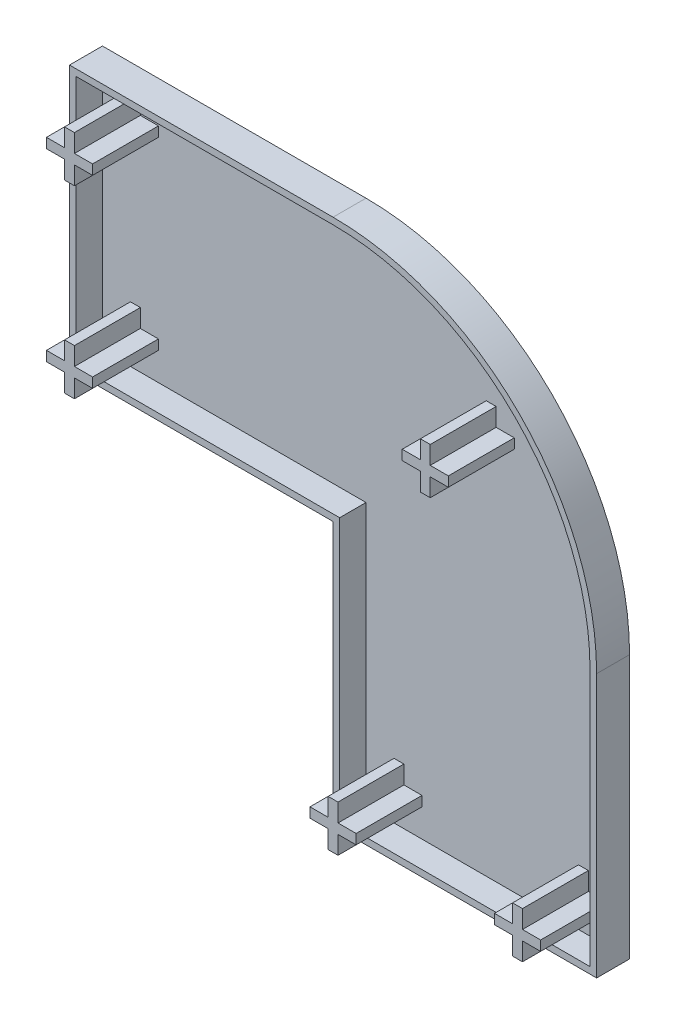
ISO-10303-21;
HEADER;
FILE_DESCRIPTION(('STEP AP214'),'2;1');
FILE_NAME('part.step','',(''),(''),'','','');
FILE_SCHEMA(('AUTOMOTIVE_DESIGN { 1 0 10303 214 1 1 1 1 }'));
ENDSEC;
DATA;
#1=APPLICATION_CONTEXT('core data for automotive mechanical design processes');
#2=APPLICATION_PROTOCOL_DEFINITION('international standard','automotive_design',2000,#1);
#3=PRODUCT_CONTEXT('',#1,'mechanical');
#4=PRODUCT('Part','Part','',(#3));
#5=PRODUCT_RELATED_PRODUCT_CATEGORY('part','',(#4));
#6=PRODUCT_DEFINITION_FORMATION('','',#4);
#7=PRODUCT_DEFINITION_CONTEXT('part definition',#1,'design');
#8=PRODUCT_DEFINITION('design','',#6,#7);
#9=PRODUCT_DEFINITION_SHAPE('','',#8);
#10=(LENGTH_UNIT() NAMED_UNIT(*) SI_UNIT(.MILLI.,.METRE.));
#11=(NAMED_UNIT(*) PLANE_ANGLE_UNIT() SI_UNIT($,.RADIAN.));
#12=(NAMED_UNIT(*) SI_UNIT($,.STERADIAN.) SOLID_ANGLE_UNIT());
#13=UNCERTAINTY_MEASURE_WITH_UNIT(LENGTH_MEASURE(1.E-05),#10,'distance_accuracy_value','');
#14=(GEOMETRIC_REPRESENTATION_CONTEXT(3) GLOBAL_UNCERTAINTY_ASSIGNED_CONTEXT((#13)) GLOBAL_UNIT_ASSIGNED_CONTEXT((#10,
#11,#12)) REPRESENTATION_CONTEXT('',''));
#15=CARTESIAN_POINT('',(0.,0.,0.));
#16=DIRECTION('',(0.,0.,1.));
#17=DIRECTION('',(1.,0.,0.));
#18=AXIS2_PLACEMENT_3D('',#15,#16,#17);
#19=CARTESIAN_POINT('',(0.,0.,-1.5));
#20=DIRECTION('',(0.,0.,1.));
#21=DIRECTION('',(1.,0.,0.));
#22=AXIS2_PLACEMENT_3D('',#19,#20,#21);
#23=PLANE('',#22);
#24=DIRECTION('',(1.,0.,0.));
#25=VECTOR('',#24,1.);
#26=CARTESIAN_POINT('',(-33.25,30.5,-1.5));
#27=LINE('',#26,#25);
#28=CARTESIAN_POINT('',(-34.75,30.5,-1.5));
#29=VERTEX_POINT('',#28);
#30=CARTESIAN_POINT('',(-33.25,30.5,-1.5));
#31=VERTEX_POINT('',#30);
#32=EDGE_CURVE('E523',#29,#31,#27,.T.);
#33=ORIENTED_EDGE('',*,*,#32,.F.);
#34=DIRECTION('',(0.,-1.,0.));
#35=VECTOR('',#34,1.);
#36=CARTESIAN_POINT('',(-34.75,30.5,-1.5));
#37=LINE('',#36,#35);
#38=CARTESIAN_POINT('',(-34.75,33.25,-1.5));
#39=VERTEX_POINT('',#38);
#40=EDGE_CURVE('E520',#39,#29,#37,.T.);
#41=ORIENTED_EDGE('',*,*,#40,.F.);
#42=DIRECTION('',(1.,0.,0.));
#43=VECTOR('',#42,1.);
#44=CARTESIAN_POINT('',(-34.75,33.25,-1.5));
#45=LINE('',#44,#43);
#46=CARTESIAN_POINT('',(-37.5,33.25,-1.5));
#47=VERTEX_POINT('',#46);
#48=EDGE_CURVE('E533',#47,#39,#45,.T.);
#49=ORIENTED_EDGE('',*,*,#48,.F.);
#50=DIRECTION('',(0.,-1.,0.));
#51=VECTOR('',#50,1.);
#52=CARTESIAN_POINT('',(-37.5,33.25,-1.5));
#53=LINE('',#52,#51);
#54=CARTESIAN_POINT('',(-37.5,34.75,-1.5));
#55=VERTEX_POINT('',#54);
#56=EDGE_CURVE('E573',#55,#47,#53,.T.);
#57=ORIENTED_EDGE('',*,*,#56,.F.);
#58=DIRECTION('',(-1.,0.,0.));
#59=VECTOR('',#58,1.);
#60=CARTESIAN_POINT('',(-34.75,34.75,-1.5));
#61=LINE('',#60,#59);
#62=CARTESIAN_POINT('',(-34.75,34.75,-1.5));
#63=VERTEX_POINT('',#62);
#64=EDGE_CURVE('E571',#63,#55,#61,.T.);
#65=ORIENTED_EDGE('',*,*,#64,.F.);
#66=DIRECTION('',(0.,-1.,0.));
#67=VECTOR('',#66,1.);
#68=CARTESIAN_POINT('',(-34.75,34.75,-1.5));
#69=LINE('',#68,#67);
#70=CARTESIAN_POINT('',(-34.75,37.5,-1.5));
#71=VERTEX_POINT('',#70);
#72=EDGE_CURVE('E569',#71,#63,#69,.T.);
#73=ORIENTED_EDGE('',*,*,#72,.F.);
#74=DIRECTION('',(-1.,0.,0.));
#75=VECTOR('',#74,1.);
#76=CARTESIAN_POINT('',(-33.25,37.5,-1.5));
#77=LINE('',#76,#75);
#78=CARTESIAN_POINT('',(-33.25,37.5,-1.5));
#79=VERTEX_POINT('',#78);
#80=EDGE_CURVE('E567',#79,#71,#77,.T.);
#81=ORIENTED_EDGE('',*,*,#80,.F.);
#82=DIRECTION('',(0.,1.,0.));
#83=VECTOR('',#82,1.);
#84=CARTESIAN_POINT('',(-33.25,34.75,-1.5));
#85=LINE('',#84,#83);
#86=CARTESIAN_POINT('',(-33.25,34.75,-1.5));
#87=VERTEX_POINT('',#86);
#88=EDGE_CURVE('E565',#87,#79,#85,.T.);
#89=ORIENTED_EDGE('',*,*,#88,.F.);
#90=DIRECTION('',(-1.,0.,0.));
#91=VECTOR('',#90,1.);
#92=CARTESIAN_POINT('',(-30.5,34.75,-1.5));
#93=LINE('',#92,#91);
#94=CARTESIAN_POINT('',(-30.5,34.75,-1.5));
#95=VERTEX_POINT('',#94);
#96=EDGE_CURVE('E563',#95,#87,#93,.T.);
#97=ORIENTED_EDGE('',*,*,#96,.F.);
#98=DIRECTION('',(0.,1.,0.));
#99=VECTOR('',#98,1.);
#100=CARTESIAN_POINT('',(-30.5,33.25,-1.5));
#101=LINE('',#100,#99);
#102=CARTESIAN_POINT('',(-30.5,33.25,-1.5));
#103=VERTEX_POINT('',#102);
#104=EDGE_CURVE('E561',#103,#95,#101,.T.);
#105=ORIENTED_EDGE('',*,*,#104,.F.);
#106=DIRECTION('',(1.,0.,0.));
#107=VECTOR('',#106,1.);
#108=CARTESIAN_POINT('',(-30.5,33.25,-1.5));
#109=LINE('',#108,#107);
#110=CARTESIAN_POINT('',(-33.25,33.25,-1.5));
#111=VERTEX_POINT('',#110);
#112=EDGE_CURVE('E559',#111,#103,#109,.T.);
#113=ORIENTED_EDGE('',*,*,#112,.F.);
#114=DIRECTION('',(0.,1.,0.));
#115=VECTOR('',#114,1.);
#116=CARTESIAN_POINT('',(-33.25,30.5,-1.5));
#117=LINE('',#116,#115);
#118=EDGE_CURVE('E557',#31,#111,#117,.T.);
#119=ORIENTED_EDGE('',*,*,#118,.F.);
#120=EDGE_LOOP('',(#33,#41,#49,#57,#65,#73,#81,#89,#97,#105,#113,#119));
#121=FACE_BOUND('',#120,.T.);
#122=DIRECTION('',(1.,0.,0.));
#123=VECTOR('',#122,1.);
#124=CARTESIAN_POINT('',(2.5,-34.75,-1.5));
#125=LINE('',#124,#123);
#126=CARTESIAN_POINT('',(2.5,-34.75,-1.5));
#127=VERTEX_POINT('',#126);
#128=CARTESIAN_POINT('',(5.25,-34.75,-1.5));
#129=VERTEX_POINT('',#128);
#130=EDGE_CURVE('E723',#127,#129,#125,.T.);
#131=ORIENTED_EDGE('',*,*,#130,.F.);
#132=DIRECTION('',(0.,-1.,0.));
#133=VECTOR('',#132,1.);
#134=CARTESIAN_POINT('',(2.5,-33.25,-1.5));
#135=LINE('',#134,#133);
#136=CARTESIAN_POINT('',(2.5,-33.25,-1.5));
#137=VERTEX_POINT('',#136);
#138=EDGE_CURVE('E693',#137,#127,#135,.T.);
#139=ORIENTED_EDGE('',*,*,#138,.F.);
#140=DIRECTION('',(-1.,0.,0.));
#141=VECTOR('',#140,1.);
#142=CARTESIAN_POINT('',(2.5,-33.25,-1.5));
#143=LINE('',#142,#141);
#144=CARTESIAN_POINT('',(5.25,-33.25,-1.5));
#145=VERTEX_POINT('',#144);
#146=EDGE_CURVE('E698',#145,#137,#143,.T.);
#147=ORIENTED_EDGE('',*,*,#146,.F.);
#148=DIRECTION('',(0.,-1.,0.));
#149=VECTOR('',#148,1.);
#150=CARTESIAN_POINT('',(5.25,-30.5,-1.5));
#151=LINE('',#150,#149);
#152=CARTESIAN_POINT('',(5.25,-30.5,-1.5));
#153=VERTEX_POINT('',#152);
#154=EDGE_CURVE('E741',#153,#145,#151,.T.);
#155=ORIENTED_EDGE('',*,*,#154,.F.);
#156=DIRECTION('',(-1.,0.,0.));
#157=VECTOR('',#156,1.);
#158=CARTESIAN_POINT('',(5.25,-30.5,-1.5));
#159=LINE('',#158,#157);
#160=CARTESIAN_POINT('',(6.75,-30.5,-1.5));
#161=VERTEX_POINT('',#160);
#162=EDGE_CURVE('E739',#161,#153,#159,.T.);
#163=ORIENTED_EDGE('',*,*,#162,.F.);
#164=DIRECTION('',(0.,1.,0.));
#165=VECTOR('',#164,1.);
#166=CARTESIAN_POINT('',(6.75,-30.5,-1.5));
#167=LINE('',#166,#165);
#168=CARTESIAN_POINT('',(6.75,-33.25,-1.5));
#169=VERTEX_POINT('',#168);
#170=EDGE_CURVE('E737',#169,#161,#167,.T.);
#171=ORIENTED_EDGE('',*,*,#170,.F.);
#172=DIRECTION('',(-1.,0.,0.));
#173=VECTOR('',#172,1.);
#174=CARTESIAN_POINT('',(6.75,-33.25,-1.5));
#175=LINE('',#174,#173);
#176=CARTESIAN_POINT('',(9.5,-33.25,-1.5));
#177=VERTEX_POINT('',#176);
#178=EDGE_CURVE('E735',#177,#169,#175,.T.);
#179=ORIENTED_EDGE('',*,*,#178,.F.);
#180=DIRECTION('',(0.,1.,0.));
#181=VECTOR('',#180,1.);
#182=CARTESIAN_POINT('',(9.5,-33.25,-1.5));
#183=LINE('',#182,#181);
#184=CARTESIAN_POINT('',(9.5,-34.75,-1.5));
#185=VERTEX_POINT('',#184);
#186=EDGE_CURVE('E733',#185,#177,#183,.T.);
#187=ORIENTED_EDGE('',*,*,#186,.F.);
#188=DIRECTION('',(1.,0.,0.));
#189=VECTOR('',#188,1.);
#190=CARTESIAN_POINT('',(6.75,-34.75,-1.5));
#191=LINE('',#190,#189);
#192=CARTESIAN_POINT('',(6.75,-34.75,-1.5));
#193=VERTEX_POINT('',#192);
#194=EDGE_CURVE('E731',#193,#185,#191,.T.);
#195=ORIENTED_EDGE('',*,*,#194,.F.);
#196=DIRECTION('',(0.,1.,0.));
#197=VECTOR('',#196,1.);
#198=CARTESIAN_POINT('',(6.75,-34.75,-1.5));
#199=LINE('',#198,#197);
#200=CARTESIAN_POINT('',(6.75,-37.5,-1.5));
#201=VERTEX_POINT('',#200);
#202=EDGE_CURVE('E729',#201,#193,#199,.T.);
#203=ORIENTED_EDGE('',*,*,#202,.F.);
#204=DIRECTION('',(1.,0.,0.));
#205=VECTOR('',#204,1.);
#206=CARTESIAN_POINT('',(5.25,-37.5,-1.5));
#207=LINE('',#206,#205);
#208=CARTESIAN_POINT('',(5.25,-37.5,-1.5));
#209=VERTEX_POINT('',#208);
#210=EDGE_CURVE('E727',#209,#201,#207,.T.);
#211=ORIENTED_EDGE('',*,*,#210,.F.);
#212=DIRECTION('',(0.,-1.,0.));
#213=VECTOR('',#212,1.);
#214=CARTESIAN_POINT('',(5.25,-34.75,-1.5));
#215=LINE('',#214,#213);
#216=EDGE_CURVE('E725',#129,#209,#215,.T.);
#217=ORIENTED_EDGE('',*,*,#216,.F.);
#218=EDGE_LOOP('',(#131,#139,#147,#155,#163,#171,#179,#187,#195,#203,#211,#217));
#219=FACE_BOUND('',#218,.T.);
#220=DIRECTION('',(0.,-1.,0.));
#221=VECTOR('',#220,1.);
#222=CARTESIAN_POINT('',(-39.,40.,-1.5));
#223=LINE('',#222,#221);
#224=CARTESIAN_POINT('',(-39.,39.,-1.5));
#225=VERTEX_POINT('',#224);
#226=CARTESIAN_POINT('',(-39.,1.,-1.5));
#227=VERTEX_POINT('',#226);
#228=EDGE_CURVE('E863',#225,#227,#223,.T.);
#229=ORIENTED_EDGE('',*,*,#228,.T.);
#230=DIRECTION('',(1.,0.,0.));
#231=VECTOR('',#230,1.);
#232=CARTESIAN_POINT('',(-40.,1.,-1.5));
#233=LINE('',#232,#231);
#234=CARTESIAN_POINT('',(1.,1.,-1.5));
#235=VERTEX_POINT('',#234);
#236=EDGE_CURVE('E866',#227,#235,#233,.T.);
#237=ORIENTED_EDGE('',*,*,#236,.T.);
#238=DIRECTION('',(0.,-1.,0.));
#239=VECTOR('',#238,1.);
#240=CARTESIAN_POINT('',(1.,-40.,-1.5));
#241=LINE('',#240,#239);
#242=CARTESIAN_POINT('',(1.,-39.,-1.5));
#243=VERTEX_POINT('',#242);
#244=EDGE_CURVE('E878',#235,#243,#241,.T.);
#245=ORIENTED_EDGE('',*,*,#244,.T.);
#246=DIRECTION('',(1.,0.,0.));
#247=VECTOR('',#246,1.);
#248=CARTESIAN_POINT('',(0.,-39.,-1.5));
#249=LINE('',#248,#247);
#250=CARTESIAN_POINT('',(39.,-39.,-1.5));
#251=VERTEX_POINT('',#250);
#252=EDGE_CURVE('E883',#243,#251,#249,.T.);
#253=ORIENTED_EDGE('',*,*,#252,.T.);
#254=DIRECTION('',(0.,1.,0.));
#255=VECTOR('',#254,1.);
#256=CARTESIAN_POINT('',(39.,0.,-1.5));
#257=LINE('',#256,#255);
#258=CARTESIAN_POINT('',(39.,0.,-1.5));
#259=VERTEX_POINT('',#258);
#260=EDGE_CURVE('E888',#251,#259,#257,.T.);
#261=ORIENTED_EDGE('',*,*,#260,.T.);
#262=CARTESIAN_POINT('',(0.,0.,-1.5));
#263=DIRECTION('',(0.,0.,1.));
#264=DIRECTION('',(1.,0.,0.));
#265=AXIS2_PLACEMENT_3D('',#262,#263,#264);
#266=CIRCLE('',#265,39.);
#267=CARTESIAN_POINT('',(0.,39.,-1.5));
#268=VERTEX_POINT('',#267);
#269=EDGE_CURVE('E893',#259,#268,#266,.T.);
#270=ORIENTED_EDGE('',*,*,#269,.T.);
#271=DIRECTION('',(-1.,0.,0.));
#272=VECTOR('',#271,1.);
#273=CARTESIAN_POINT('',(-40.,39.,-1.5));
#274=LINE('',#273,#272);
#275=EDGE_CURVE('E897',#268,#225,#274,.T.);
#276=ORIENTED_EDGE('',*,*,#275,.T.);
#277=EDGE_LOOP('',(#229,#237,#245,#253,#261,#270,#276));
#278=FACE_BOUND('',#277,.T.);
#279=DIRECTION('',(1.,0.,0.));
#280=VECTOR('',#279,1.);
#281=CARTESIAN_POINT('',(16.5,19.25,-1.5));
#282=LINE('',#281,#280);
#283=CARTESIAN_POINT('',(16.5,19.25,-1.5));
#284=VERTEX_POINT('',#283);
#285=CARTESIAN_POINT('',(19.25,19.25,-1.5));
#286=VERTEX_POINT('',#285);
#287=EDGE_CURVE('E808',#284,#286,#282,.T.);
#288=ORIENTED_EDGE('',*,*,#287,.F.);
#289=DIRECTION('',(0.,-1.,0.));
#290=VECTOR('',#289,1.);
#291=CARTESIAN_POINT('',(16.5,20.75,-1.5));
#292=LINE('',#291,#290);
#293=CARTESIAN_POINT('',(16.5,20.75,-1.5));
#294=VERTEX_POINT('',#293);
#295=EDGE_CURVE('E778',#294,#284,#292,.T.);
#296=ORIENTED_EDGE('',*,*,#295,.F.);
#297=DIRECTION('',(-1.,0.,0.));
#298=VECTOR('',#297,1.);
#299=CARTESIAN_POINT('',(16.5,20.75,-1.5));
#300=LINE('',#299,#298);
#301=CARTESIAN_POINT('',(19.25,20.75,-1.5));
#302=VERTEX_POINT('',#301);
#303=EDGE_CURVE('E783',#302,#294,#300,.T.);
#304=ORIENTED_EDGE('',*,*,#303,.F.);
#305=DIRECTION('',(0.,-1.,0.));
#306=VECTOR('',#305,1.);
#307=CARTESIAN_POINT('',(19.25,23.5,-1.5));
#308=LINE('',#307,#306);
#309=CARTESIAN_POINT('',(19.25,23.5,-1.5));
#310=VERTEX_POINT('',#309);
#311=EDGE_CURVE('E826',#310,#302,#308,.T.);
#312=ORIENTED_EDGE('',*,*,#311,.F.);
#313=DIRECTION('',(-1.,0.,0.));
#314=VECTOR('',#313,1.);
#315=CARTESIAN_POINT('',(19.25,23.5,-1.5));
#316=LINE('',#315,#314);
#317=CARTESIAN_POINT('',(20.75,23.5,-1.5));
#318=VERTEX_POINT('',#317);
#319=EDGE_CURVE('E824',#318,#310,#316,.T.);
#320=ORIENTED_EDGE('',*,*,#319,.F.);
#321=DIRECTION('',(0.,1.,0.));
#322=VECTOR('',#321,1.);
#323=CARTESIAN_POINT('',(20.75,23.5,-1.5));
#324=LINE('',#323,#322);
#325=CARTESIAN_POINT('',(20.75,20.75,-1.5));
#326=VERTEX_POINT('',#325);
#327=EDGE_CURVE('E822',#326,#318,#324,.T.);
#328=ORIENTED_EDGE('',*,*,#327,.F.);
#329=DIRECTION('',(-1.,0.,0.));
#330=VECTOR('',#329,1.);
#331=CARTESIAN_POINT('',(20.75,20.75,-1.5));
#332=LINE('',#331,#330);
#333=CARTESIAN_POINT('',(23.5,20.75,-1.5));
#334=VERTEX_POINT('',#333);
#335=EDGE_CURVE('E820',#334,#326,#332,.T.);
#336=ORIENTED_EDGE('',*,*,#335,.F.);
#337=DIRECTION('',(0.,1.,0.));
#338=VECTOR('',#337,1.);
#339=CARTESIAN_POINT('',(23.5,20.75,-1.5));
#340=LINE('',#339,#338);
#341=CARTESIAN_POINT('',(23.5,19.25,-1.5));
#342=VERTEX_POINT('',#341);
#343=EDGE_CURVE('E818',#342,#334,#340,.T.);
#344=ORIENTED_EDGE('',*,*,#343,.F.);
#345=DIRECTION('',(1.,0.,0.));
#346=VECTOR('',#345,1.);
#347=CARTESIAN_POINT('',(20.75,19.25,-1.5));
#348=LINE('',#347,#346);
#349=CARTESIAN_POINT('',(20.75,19.25,-1.5));
#350=VERTEX_POINT('',#349);
#351=EDGE_CURVE('E816',#350,#342,#348,.T.);
#352=ORIENTED_EDGE('',*,*,#351,.F.);
#353=DIRECTION('',(0.,1.,0.));
#354=VECTOR('',#353,1.);
#355=CARTESIAN_POINT('',(20.75,19.25,-1.5));
#356=LINE('',#355,#354);
#357=CARTESIAN_POINT('',(20.75,16.5,-1.5));
#358=VERTEX_POINT('',#357);
#359=EDGE_CURVE('E814',#358,#350,#356,.T.);
#360=ORIENTED_EDGE('',*,*,#359,.F.);
#361=DIRECTION('',(1.,0.,0.));
#362=VECTOR('',#361,1.);
#363=CARTESIAN_POINT('',(19.25,16.5,-1.5));
#364=LINE('',#363,#362);
#365=CARTESIAN_POINT('',(19.25,16.5,-1.5));
#366=VERTEX_POINT('',#365);
#367=EDGE_CURVE('E812',#366,#358,#364,.T.);
#368=ORIENTED_EDGE('',*,*,#367,.F.);
#369=DIRECTION('',(0.,-1.,0.));
#370=VECTOR('',#369,1.);
#371=CARTESIAN_POINT('',(19.25,19.25,-1.5));
#372=LINE('',#371,#370);
#373=EDGE_CURVE('E810',#286,#366,#372,.T.);
#374=ORIENTED_EDGE('',*,*,#373,.F.);
#375=EDGE_LOOP('',(#288,#296,#304,#312,#320,#328,#336,#344,#352,#360,#368,#374));
#376=FACE_BOUND('',#375,.T.);
#377=DIRECTION('',(1.,0.,0.));
#378=VECTOR('',#377,1.);
#379=CARTESIAN_POINT('',(30.5,-34.75,-1.5));
#380=LINE('',#379,#378);
#381=CARTESIAN_POINT('',(30.5,-34.75,-1.5));
#382=VERTEX_POINT('',#381);
#383=CARTESIAN_POINT('',(33.25,-34.75,-1.5));
#384=VERTEX_POINT('',#383);
#385=EDGE_CURVE('E638',#382,#384,#380,.T.);
#386=ORIENTED_EDGE('',*,*,#385,.F.);
#387=DIRECTION('',(0.,-1.,0.));
#388=VECTOR('',#387,1.);
#389=CARTESIAN_POINT('',(30.5,-33.25,-1.5));
#390=LINE('',#389,#388);
#391=CARTESIAN_POINT('',(30.5,-33.25,-1.5));
#392=VERTEX_POINT('',#391);
#393=EDGE_CURVE('E608',#392,#382,#390,.T.);
#394=ORIENTED_EDGE('',*,*,#393,.F.);
#395=DIRECTION('',(-1.,0.,0.));
#396=VECTOR('',#395,1.);
#397=CARTESIAN_POINT('',(30.5,-33.25,-1.5));
#398=LINE('',#397,#396);
#399=CARTESIAN_POINT('',(33.25,-33.25,-1.5));
#400=VERTEX_POINT('',#399);
#401=EDGE_CURVE('E613',#400,#392,#398,.T.);
#402=ORIENTED_EDGE('',*,*,#401,.F.);
#403=DIRECTION('',(0.,-1.,0.));
#404=VECTOR('',#403,1.);
#405=CARTESIAN_POINT('',(33.25,-30.5,-1.5));
#406=LINE('',#405,#404);
#407=CARTESIAN_POINT('',(33.25,-30.5,-1.5));
#408=VERTEX_POINT('',#407);
#409=EDGE_CURVE('E656',#408,#400,#406,.T.);
#410=ORIENTED_EDGE('',*,*,#409,.F.);
#411=DIRECTION('',(-1.,0.,0.));
#412=VECTOR('',#411,1.);
#413=CARTESIAN_POINT('',(33.25,-30.5,-1.5));
#414=LINE('',#413,#412);
#415=CARTESIAN_POINT('',(34.75,-30.5,-1.5));
#416=VERTEX_POINT('',#415);
#417=EDGE_CURVE('E654',#416,#408,#414,.T.);
#418=ORIENTED_EDGE('',*,*,#417,.F.);
#419=DIRECTION('',(0.,1.,0.));
#420=VECTOR('',#419,1.);
#421=CARTESIAN_POINT('',(34.75,-30.5,-1.5));
#422=LINE('',#421,#420);
#423=CARTESIAN_POINT('',(34.75,-33.25,-1.5));
#424=VERTEX_POINT('',#423);
#425=EDGE_CURVE('E652',#424,#416,#422,.T.);
#426=ORIENTED_EDGE('',*,*,#425,.F.);
#427=DIRECTION('',(-1.,0.,0.));
#428=VECTOR('',#427,1.);
#429=CARTESIAN_POINT('',(34.75,-33.25,-1.5));
#430=LINE('',#429,#428);
#431=CARTESIAN_POINT('',(37.5,-33.25,-1.5));
#432=VERTEX_POINT('',#431);
#433=EDGE_CURVE('E650',#432,#424,#430,.T.);
#434=ORIENTED_EDGE('',*,*,#433,.F.);
#435=DIRECTION('',(0.,1.,0.));
#436=VECTOR('',#435,1.);
#437=CARTESIAN_POINT('',(37.5,-33.25,-1.5));
#438=LINE('',#437,#436);
#439=CARTESIAN_POINT('',(37.5,-34.75,-1.5));
#440=VERTEX_POINT('',#439);
#441=EDGE_CURVE('E648',#440,#432,#438,.T.);
#442=ORIENTED_EDGE('',*,*,#441,.F.);
#443=DIRECTION('',(1.,0.,0.));
#444=VECTOR('',#443,1.);
#445=CARTESIAN_POINT('',(34.75,-34.75,-1.5));
#446=LINE('',#445,#444);
#447=CARTESIAN_POINT('',(34.75,-34.75,-1.5));
#448=VERTEX_POINT('',#447);
#449=EDGE_CURVE('E646',#448,#440,#446,.T.);
#450=ORIENTED_EDGE('',*,*,#449,.F.);
#451=DIRECTION('',(0.,1.,0.));
#452=VECTOR('',#451,1.);
#453=CARTESIAN_POINT('',(34.75,-34.75,-1.5));
#454=LINE('',#453,#452);
#455=CARTESIAN_POINT('',(34.75,-37.5,-1.5));
#456=VERTEX_POINT('',#455);
#457=EDGE_CURVE('E644',#456,#448,#454,.T.);
#458=ORIENTED_EDGE('',*,*,#457,.F.);
#459=DIRECTION('',(1.,0.,0.));
#460=VECTOR('',#459,1.);
#461=CARTESIAN_POINT('',(33.25,-37.5,-1.5));
#462=LINE('',#461,#460);
#463=CARTESIAN_POINT('',(33.25,-37.5,-1.5));
#464=VERTEX_POINT('',#463);
#465=EDGE_CURVE('E642',#464,#456,#462,.T.);
#466=ORIENTED_EDGE('',*,*,#465,.F.);
#467=DIRECTION('',(0.,-1.,0.));
#468=VECTOR('',#467,1.);
#469=CARTESIAN_POINT('',(33.25,-34.75,-1.5));
#470=LINE('',#469,#468);
#471=EDGE_CURVE('E640',#384,#464,#470,.T.);
#472=ORIENTED_EDGE('',*,*,#471,.F.);
#473=EDGE_LOOP('',(#386,#394,#402,#410,#418,#426,#434,#442,#450,#458,#466,#472));
#474=FACE_BOUND('',#473,.T.);
#475=DIRECTION('',(1.,0.,0.));
#476=VECTOR('',#475,1.);
#477=CARTESIAN_POINT('',(-33.25,2.49999999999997,-1.5));
#478=LINE('',#477,#476);
#479=CARTESIAN_POINT('',(-34.75,2.49999999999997,-1.5));
#480=VERTEX_POINT('',#479);
#481=CARTESIAN_POINT('',(-33.25,2.49999999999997,-1.5));
#482=VERTEX_POINT('',#481);
#483=EDGE_CURVE('E1083',#480,#482,#478,.T.);
#484=ORIENTED_EDGE('',*,*,#483,.F.);
#485=DIRECTION('',(0.,-1.,0.));
#486=VECTOR('',#485,1.);
#487=CARTESIAN_POINT('',(-34.75,2.49999999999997,-1.5));
#488=LINE('',#487,#486);
#489=CARTESIAN_POINT('',(-34.75,5.24999999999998,-1.5));
#490=VERTEX_POINT('',#489);
#491=EDGE_CURVE('E518',#490,#480,#488,.T.);
#492=ORIENTED_EDGE('',*,*,#491,.F.);
#493=DIRECTION('',(1.,0.,0.));
#494=VECTOR('',#493,1.);
#495=CARTESIAN_POINT('',(-34.75,5.24999999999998,-1.5));
#496=LINE('',#495,#494);
#497=CARTESIAN_POINT('',(-37.5,5.24999999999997,-1.5));
#498=VERTEX_POINT('',#497);
#499=EDGE_CURVE('E514',#498,#490,#496,.T.);
#500=ORIENTED_EDGE('',*,*,#499,.F.);
#501=DIRECTION('',(0.,-1.,0.));
#502=VECTOR('',#501,1.);
#503=CARTESIAN_POINT('',(-37.5,5.24999999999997,-1.5));
#504=LINE('',#503,#502);
#505=CARTESIAN_POINT('',(-37.5,6.74999999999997,-1.5));
#506=VERTEX_POINT('',#505);
#507=EDGE_CURVE('E1106',#506,#498,#504,.T.);
#508=ORIENTED_EDGE('',*,*,#507,.F.);
#509=DIRECTION('',(-1.,0.,0.));
#510=VECTOR('',#509,1.);
#511=CARTESIAN_POINT('',(-34.75,6.74999999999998,-1.5));
#512=LINE('',#511,#510);
#513=CARTESIAN_POINT('',(-34.75,6.74999999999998,-1.5));
#514=VERTEX_POINT('',#513);
#515=EDGE_CURVE('E1104',#514,#506,#512,.T.);
#516=ORIENTED_EDGE('',*,*,#515,.F.);
#517=DIRECTION('',(0.,-1.,0.));
#518=VECTOR('',#517,1.);
#519=CARTESIAN_POINT('',(-34.75,6.74999999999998,-1.5));
#520=LINE('',#519,#518);
#521=CARTESIAN_POINT('',(-34.75,9.49999999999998,-1.5));
#522=VERTEX_POINT('',#521);
#523=EDGE_CURVE('E1102',#522,#514,#520,.T.);
#524=ORIENTED_EDGE('',*,*,#523,.F.);
#525=DIRECTION('',(-1.,0.,0.));
#526=VECTOR('',#525,1.);
#527=CARTESIAN_POINT('',(-33.25,9.49999999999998,-1.5));
#528=LINE('',#527,#526);
#529=CARTESIAN_POINT('',(-33.25,9.49999999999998,-1.5));
#530=VERTEX_POINT('',#529);
#531=EDGE_CURVE('E1100',#530,#522,#528,.T.);
#532=ORIENTED_EDGE('',*,*,#531,.F.);
#533=DIRECTION('',(0.,1.,0.));
#534=VECTOR('',#533,1.);
#535=CARTESIAN_POINT('',(-33.25,6.74999999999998,-1.5));
#536=LINE('',#535,#534);
#537=CARTESIAN_POINT('',(-33.25,6.74999999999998,-1.5));
#538=VERTEX_POINT('',#537);
#539=EDGE_CURVE('E1098',#538,#530,#536,.T.);
#540=ORIENTED_EDGE('',*,*,#539,.F.);
#541=DIRECTION('',(-1.,0.,0.));
#542=VECTOR('',#541,1.);
#543=CARTESIAN_POINT('',(-30.5,6.74999999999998,-1.5));
#544=LINE('',#543,#542);
#545=CARTESIAN_POINT('',(-30.5,6.74999999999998,-1.5));
#546=VERTEX_POINT('',#545);
#547=EDGE_CURVE('E1096',#546,#538,#544,.T.);
#548=ORIENTED_EDGE('',*,*,#547,.F.);
#549=DIRECTION('',(0.,1.,0.));
#550=VECTOR('',#549,1.);
#551=CARTESIAN_POINT('',(-30.5,5.24999999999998,-1.5));
#552=LINE('',#551,#550);
#553=CARTESIAN_POINT('',(-30.5,5.24999999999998,-1.5));
#554=VERTEX_POINT('',#553);
#555=EDGE_CURVE('E1094',#554,#546,#552,.T.);
#556=ORIENTED_EDGE('',*,*,#555,.F.);
#557=DIRECTION('',(1.,0.,0.));
#558=VECTOR('',#557,1.);
#559=CARTESIAN_POINT('',(-30.5,5.24999999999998,-1.5));
#560=LINE('',#559,#558);
#561=CARTESIAN_POINT('',(-33.25,5.24999999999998,-1.5));
#562=VERTEX_POINT('',#561);
#563=EDGE_CURVE('E1088',#562,#554,#560,.T.);
#564=ORIENTED_EDGE('',*,*,#563,.F.);
#565=DIRECTION('',(0.,1.,0.));
#566=VECTOR('',#565,1.);
#567=CARTESIAN_POINT('',(-33.25,2.49999999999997,-1.5));
#568=LINE('',#567,#566);
#569=EDGE_CURVE('E1086',#482,#562,#568,.T.);
#570=ORIENTED_EDGE('',*,*,#569,.F.);
#571=EDGE_LOOP('',(#484,#492,#500,#508,#516,#524,#532,#540,#548,#556,#564,#570));
#572=FACE_BOUND('',#571,.T.);
#573=ADVANCED_FACE('F33',(#121,#219,#278,#376,#474,#572),#23,.T.);
#574=CARTESIAN_POINT('',(-40.,40.,2.5));
#575=DIRECTION('',(1.,0.,0.));
#576=DIRECTION('',(0.,1.,0.));
#577=AXIS2_PLACEMENT_3D('',#574,#575,#576);
#578=PLANE('',#577);
#579=DIRECTION('',(0.,-1.,0.));
#580=VECTOR('',#579,1.);
#581=CARTESIAN_POINT('',(-40.,40.,-2.5));
#582=LINE('',#581,#580);
#583=CARTESIAN_POINT('',(-40.,40.,-2.5));
#584=VERTEX_POINT('',#583);
#585=CARTESIAN_POINT('',(-40.,0.,-2.5));
#586=VERTEX_POINT('',#585);
#587=EDGE_CURVE('E870',#584,#586,#582,.T.);
#588=ORIENTED_EDGE('',*,*,#587,.T.);
#589=DIRECTION('',(0.,0.,-1.));
#590=VECTOR('',#589,1.);
#591=CARTESIAN_POINT('',(-40.,0.,2.5));
#592=LINE('',#591,#590);
#593=CARTESIAN_POINT('',(-40.,0.,2.5));
#594=VERTEX_POINT('',#593);
#595=EDGE_CURVE('E11',#594,#586,#592,.T.);
#596=ORIENTED_EDGE('',*,*,#595,.F.);
#597=DIRECTION('',(0.,-1.,0.));
#598=VECTOR('',#597,1.);
#599=CARTESIAN_POINT('',(-40.,40.,2.5));
#600=LINE('',#599,#598);
#601=CARTESIAN_POINT('',(-40.,40.,2.5));
#602=VERTEX_POINT('',#601);
#603=EDGE_CURVE('E915',#602,#594,#600,.T.);
#604=ORIENTED_EDGE('',*,*,#603,.F.);
#605=DIRECTION('',(0.,0.,-1.));
#606=VECTOR('',#605,1.);
#607=CARTESIAN_POINT('',(-40.,40.,2.5));
#608=LINE('',#607,#606);
#609=EDGE_CURVE('E931',#602,#584,#608,.T.);
#610=ORIENTED_EDGE('',*,*,#609,.T.);
#611=EDGE_LOOP('',(#588,#596,#604,#610));
#612=FACE_BOUND('',#611,.T.);
#613=ADVANCED_FACE('F35',(#612),#578,.F.);
#614=CARTESIAN_POINT('',(-40.,0.,2.5));
#615=DIRECTION('',(0.,1.,0.));
#616=DIRECTION('',(0.,0.,1.));
#617=AXIS2_PLACEMENT_3D('',#614,#615,#616);
#618=PLANE('',#617);
#619=DIRECTION('',(1.,0.,0.));
#620=VECTOR('',#619,1.);
#621=CARTESIAN_POINT('',(-40.,0.,-2.5));
#622=LINE('',#621,#620);
#623=CARTESIAN_POINT('',(0.,0.,-2.5));
#624=VERTEX_POINT('',#623);
#625=EDGE_CURVE('E934',#586,#624,#622,.T.);
#626=ORIENTED_EDGE('',*,*,#625,.T.);
#627=DIRECTION('',(0.,0.,-1.));
#628=VECTOR('',#627,1.);
#629=CARTESIAN_POINT('',(0.,0.,2.5));
#630=LINE('',#629,#628);
#631=CARTESIAN_POINT('',(0.,0.,2.5));
#632=VERTEX_POINT('',#631);
#633=EDGE_CURVE('E41',#632,#624,#630,.T.);
#634=ORIENTED_EDGE('',*,*,#633,.F.);
#635=DIRECTION('',(1.,0.,0.));
#636=VECTOR('',#635,1.);
#637=CARTESIAN_POINT('',(-40.,0.,2.5));
#638=LINE('',#637,#636);
#639=EDGE_CURVE('E918',#594,#632,#638,.T.);
#640=ORIENTED_EDGE('',*,*,#639,.F.);
#641=ORIENTED_EDGE('',*,*,#595,.T.);
#642=EDGE_LOOP('',(#626,#634,#640,#641));
#643=FACE_BOUND('',#642,.T.);
#644=ADVANCED_FACE('F986',(#643),#618,.F.);
#645=CARTESIAN_POINT('',(0.,-40.,2.5));
#646=DIRECTION('',(1.,0.,0.));
#647=DIRECTION('',(0.,0.,-1.));
#648=AXIS2_PLACEMENT_3D('',#645,#646,#647);
#649=PLANE('',#648);
#650=DIRECTION('',(0.,-1.,0.));
#651=VECTOR('',#650,1.);
#652=CARTESIAN_POINT('',(0.,-40.,-2.5));
#653=LINE('',#652,#651);
#654=CARTESIAN_POINT('',(0.,-40.,-2.5));
#655=VERTEX_POINT('',#654);
#656=EDGE_CURVE('E936',#624,#655,#653,.T.);
#657=ORIENTED_EDGE('',*,*,#656,.T.);
#658=DIRECTION('',(0.,0.,-1.));
#659=VECTOR('',#658,1.);
#660=CARTESIAN_POINT('',(0.,-40.,2.5));
#661=LINE('',#660,#659);
#662=CARTESIAN_POINT('',(0.,-40.,2.5));
#663=VERTEX_POINT('',#662);
#664=EDGE_CURVE('E956',#663,#655,#661,.T.);
#665=ORIENTED_EDGE('',*,*,#664,.F.);
#666=DIRECTION('',(0.,-1.,0.));
#667=VECTOR('',#666,1.);
#668=CARTESIAN_POINT('',(0.,-40.,2.5));
#669=LINE('',#668,#667);
#670=EDGE_CURVE('E921',#632,#663,#669,.T.);
#671=ORIENTED_EDGE('',*,*,#670,.F.);
#672=ORIENTED_EDGE('',*,*,#633,.T.);
#673=EDGE_LOOP('',(#657,#665,#671,#672));
#674=FACE_BOUND('',#673,.T.);
#675=ADVANCED_FACE('F963',(#674),#649,.F.);
#676=CARTESIAN_POINT('',(0.,-40.,2.5));
#677=DIRECTION('',(0.,1.,0.));
#678=DIRECTION('',(0.,0.,1.));
#679=AXIS2_PLACEMENT_3D('',#676,#677,#678);
#680=PLANE('',#679);
#681=DIRECTION('',(1.,0.,0.));
#682=VECTOR('',#681,1.);
#683=CARTESIAN_POINT('',(0.,-40.,-2.5));
#684=LINE('',#683,#682);
#685=CARTESIAN_POINT('',(40.,-40.,-2.5));
#686=VERTEX_POINT('',#685);
#687=EDGE_CURVE('E938',#655,#686,#684,.T.);
#688=ORIENTED_EDGE('',*,*,#687,.T.);
#689=DIRECTION('',(0.,0.,-1.));
#690=VECTOR('',#689,1.);
#691=CARTESIAN_POINT('',(40.,-40.,2.5));
#692=LINE('',#691,#690);
#693=CARTESIAN_POINT('',(40.,-40.,2.5));
#694=VERTEX_POINT('',#693);
#695=EDGE_CURVE('E953',#694,#686,#692,.T.);
#696=ORIENTED_EDGE('',*,*,#695,.F.);
#697=DIRECTION('',(1.,0.,0.));
#698=VECTOR('',#697,1.);
#699=CARTESIAN_POINT('',(0.,-40.,2.5));
#700=LINE('',#699,#698);
#701=EDGE_CURVE('E923',#663,#694,#700,.T.);
#702=ORIENTED_EDGE('',*,*,#701,.F.);
#703=ORIENTED_EDGE('',*,*,#664,.T.);
#704=EDGE_LOOP('',(#688,#696,#702,#703));
#705=FACE_BOUND('',#704,.T.);
#706=ADVANCED_FACE('F974',(#705),#680,.F.);
#707=CARTESIAN_POINT('',(40.,0.,2.5));
#708=DIRECTION('',(-1.,0.,0.));
#709=DIRECTION('',(0.,-1.,0.));
#710=AXIS2_PLACEMENT_3D('',#707,#708,#709);
#711=PLANE('',#710);
#712=DIRECTION('',(0.,1.,0.));
#713=VECTOR('',#712,1.);
#714=CARTESIAN_POINT('',(40.,0.,-2.5));
#715=LINE('',#714,#713);
#716=CARTESIAN_POINT('',(40.,0.,-2.5));
#717=VERTEX_POINT('',#716);
#718=EDGE_CURVE('E940',#686,#717,#715,.T.);
#719=ORIENTED_EDGE('',*,*,#718,.T.);
#720=DIRECTION('',(0.,0.,-1.));
#721=VECTOR('',#720,1.);
#722=CARTESIAN_POINT('',(40.,0.,2.5));
#723=LINE('',#722,#721);
#724=CARTESIAN_POINT('',(40.,0.,2.5));
#725=VERTEX_POINT('',#724);
#726=EDGE_CURVE('E950',#725,#717,#723,.T.);
#727=ORIENTED_EDGE('',*,*,#726,.F.);
#728=DIRECTION('',(0.,1.,0.));
#729=VECTOR('',#728,1.);
#730=CARTESIAN_POINT('',(40.,0.,2.5));
#731=LINE('',#730,#729);
#732=EDGE_CURVE('E925',#694,#725,#731,.T.);
#733=ORIENTED_EDGE('',*,*,#732,.F.);
#734=ORIENTED_EDGE('',*,*,#695,.T.);
#735=EDGE_LOOP('',(#719,#727,#733,#734));
#736=FACE_BOUND('',#735,.T.);
#737=ADVANCED_FACE('F978',(#736),#711,.F.);
#738=CARTESIAN_POINT('',(0.,0.,2.5));
#739=DIRECTION('',(0.,0.,-1.));
#740=DIRECTION('',(-1.,0.,0.));
#741=AXIS2_PLACEMENT_3D('',#738,#739,#740);
#742=CYLINDRICAL_SURFACE('',#741,40.);
#743=CARTESIAN_POINT('',(0.,0.,-2.5));
#744=DIRECTION('',(0.,0.,1.));
#745=DIRECTION('',(1.,0.,0.));
#746=AXIS2_PLACEMENT_3D('',#743,#744,#745);
#747=CIRCLE('',#746,40.);
#748=CARTESIAN_POINT('',(0.,40.,-2.5));
#749=VERTEX_POINT('',#748);
#750=EDGE_CURVE('E942',#717,#749,#747,.T.);
#751=ORIENTED_EDGE('',*,*,#750,.T.);
#752=DIRECTION('',(0.,0.,-1.));
#753=VECTOR('',#752,1.);
#754=CARTESIAN_POINT('',(0.,40.,2.5));
#755=LINE('',#754,#753);
#756=CARTESIAN_POINT('',(0.,40.,2.5));
#757=VERTEX_POINT('',#756);
#758=EDGE_CURVE('E947',#757,#749,#755,.T.);
#759=ORIENTED_EDGE('',*,*,#758,.F.);
#760=CARTESIAN_POINT('',(0.,0.,2.5));
#761=DIRECTION('',(0.,0.,1.));
#762=DIRECTION('',(1.,0.,0.));
#763=AXIS2_PLACEMENT_3D('',#760,#761,#762);
#764=CIRCLE('',#763,40.);
#765=EDGE_CURVE('E927',#725,#757,#764,.T.);
#766=ORIENTED_EDGE('',*,*,#765,.F.);
#767=ORIENTED_EDGE('',*,*,#726,.T.);
#768=EDGE_LOOP('',(#751,#759,#766,#767));
#769=FACE_BOUND('',#768,.T.);
#770=ADVANCED_FACE('F994',(#769),#742,.T.);
#771=CARTESIAN_POINT('',(-40.,40.,2.5));
#772=DIRECTION('',(0.,-1.,0.));
#773=DIRECTION('',(1.,0.,0.));
#774=AXIS2_PLACEMENT_3D('',#771,#772,#773);
#775=PLANE('',#774);
#776=DIRECTION('',(-1.,0.,0.));
#777=VECTOR('',#776,1.);
#778=CARTESIAN_POINT('',(-40.,40.,-2.5));
#779=LINE('',#778,#777);
#780=EDGE_CURVE('E919',#749,#584,#779,.T.);
#781=ORIENTED_EDGE('',*,*,#780,.T.);
#782=ORIENTED_EDGE('',*,*,#609,.F.);
#783=DIRECTION('',(-1.,0.,0.));
#784=VECTOR('',#783,1.);
#785=CARTESIAN_POINT('',(-40.,40.,2.5));
#786=LINE('',#785,#784);
#787=EDGE_CURVE('E929',#757,#602,#786,.T.);
#788=ORIENTED_EDGE('',*,*,#787,.F.);
#789=ORIENTED_EDGE('',*,*,#758,.T.);
#790=EDGE_LOOP('',(#781,#782,#788,#789));
#791=FACE_BOUND('',#790,.T.);
#792=ADVANCED_FACE('F991',(#791),#775,.F.);
#793=CARTESIAN_POINT('',(0.,0.,2.5));
#794=DIRECTION('',(0.,0.,1.));
#795=DIRECTION('',(1.,0.,0.));
#796=AXIS2_PLACEMENT_3D('',#793,#794,#795);
#797=PLANE('',#796);
#798=DIRECTION('',(0.,-1.,0.));
#799=VECTOR('',#798,1.);
#800=CARTESIAN_POINT('',(-39.,40.,2.5));
#801=LINE('',#800,#799);
#802=CARTESIAN_POINT('',(-39.,39.,2.5));
#803=VERTEX_POINT('',#802);
#804=CARTESIAN_POINT('',(-39.,1.,2.5));
#805=VERTEX_POINT('',#804);
#806=EDGE_CURVE('E901',#803,#805,#801,.T.);
#807=ORIENTED_EDGE('',*,*,#806,.F.);
#808=DIRECTION('',(-1.,0.,0.));
#809=VECTOR('',#808,1.);
#810=CARTESIAN_POINT('',(-40.,39.,2.5));
#811=LINE('',#810,#809);
#812=CARTESIAN_POINT('',(0.,39.,2.5));
#813=VERTEX_POINT('',#812);
#814=EDGE_CURVE('E876',#813,#803,#811,.T.);
#815=ORIENTED_EDGE('',*,*,#814,.F.);
#816=CARTESIAN_POINT('',(0.,0.,2.5));
#817=DIRECTION('',(0.,0.,1.));
#818=DIRECTION('',(1.,0.,0.));
#819=AXIS2_PLACEMENT_3D('',#816,#817,#818);
#820=CIRCLE('',#819,39.);
#821=CARTESIAN_POINT('',(39.,0.,2.5));
#822=VERTEX_POINT('',#821);
#823=EDGE_CURVE('E911',#822,#813,#820,.T.);
#824=ORIENTED_EDGE('',*,*,#823,.F.);
#825=DIRECTION('',(0.,1.,0.));
#826=VECTOR('',#825,1.);
#827=CARTESIAN_POINT('',(39.,0.,2.5));
#828=LINE('',#827,#826);
#829=CARTESIAN_POINT('',(39.,-39.,2.5));
#830=VERTEX_POINT('',#829);
#831=EDGE_CURVE('E909',#830,#822,#828,.T.);
#832=ORIENTED_EDGE('',*,*,#831,.F.);
#833=DIRECTION('',(1.,0.,0.));
#834=VECTOR('',#833,1.);
#835=CARTESIAN_POINT('',(0.,-39.,2.5));
#836=LINE('',#835,#834);
#837=CARTESIAN_POINT('',(1.,-39.,2.5));
#838=VERTEX_POINT('',#837);
#839=EDGE_CURVE('E907',#838,#830,#836,.T.);
#840=ORIENTED_EDGE('',*,*,#839,.F.);
#841=DIRECTION('',(0.,-1.,0.));
#842=VECTOR('',#841,1.);
#843=CARTESIAN_POINT('',(1.,-40.,2.5));
#844=LINE('',#843,#842);
#845=CARTESIAN_POINT('',(1.,1.,2.5));
#846=VERTEX_POINT('',#845);
#847=EDGE_CURVE('E905',#846,#838,#844,.T.);
#848=ORIENTED_EDGE('',*,*,#847,.F.);
#849=DIRECTION('',(1.,0.,0.));
#850=VECTOR('',#849,1.);
#851=CARTESIAN_POINT('',(-40.,1.,2.5));
#852=LINE('',#851,#850);
#853=EDGE_CURVE('E903',#805,#846,#852,.T.);
#854=ORIENTED_EDGE('',*,*,#853,.F.);
#855=EDGE_LOOP('',(#807,#815,#824,#832,#840,#848,#854));
#856=FACE_BOUND('',#855,.T.);
#857=ORIENTED_EDGE('',*,*,#603,.T.);
#858=ORIENTED_EDGE('',*,*,#639,.T.);
#859=ORIENTED_EDGE('',*,*,#670,.T.);
#860=ORIENTED_EDGE('',*,*,#701,.T.);
#861=ORIENTED_EDGE('',*,*,#732,.T.);
#862=ORIENTED_EDGE('',*,*,#765,.T.);
#863=ORIENTED_EDGE('',*,*,#787,.T.);
#864=EDGE_LOOP('',(#857,#858,#859,#860,#861,#862,#863));
#865=FACE_BOUND('',#864,.T.);
#866=ADVANCED_FACE('F982',(#856,#865),#797,.T.);
#867=CARTESIAN_POINT('',(0.,0.,-2.5));
#868=DIRECTION('',(0.,0.,1.));
#869=DIRECTION('',(1.,0.,0.));
#870=AXIS2_PLACEMENT_3D('',#867,#868,#869);
#871=PLANE('',#870);
#872=ORIENTED_EDGE('',*,*,#587,.F.);
#873=ORIENTED_EDGE('',*,*,#780,.F.);
#874=ORIENTED_EDGE('',*,*,#750,.F.);
#875=ORIENTED_EDGE('',*,*,#718,.F.);
#876=ORIENTED_EDGE('',*,*,#687,.F.);
#877=ORIENTED_EDGE('',*,*,#656,.F.);
#878=ORIENTED_EDGE('',*,*,#625,.F.);
#879=EDGE_LOOP('',(#872,#873,#874,#875,#876,#877,#878));
#880=FACE_BOUND('',#879,.T.);
#881=ADVANCED_FACE('F969',(#880),#871,.F.);
#882=CARTESIAN_POINT('',(-39.,40.,2.5));
#883=DIRECTION('',(1.,0.,0.));
#884=DIRECTION('',(0.,1.,0.));
#885=AXIS2_PLACEMENT_3D('',#882,#883,#884);
#886=PLANE('',#885);
#887=ORIENTED_EDGE('',*,*,#228,.F.);
#888=DIRECTION('',(0.,0.,-1.));
#889=VECTOR('',#888,1.);
#890=CARTESIAN_POINT('',(-39.,39.,2.5));
#891=LINE('',#890,#889);
#892=EDGE_CURVE('E872',#803,#225,#891,.T.);
#893=ORIENTED_EDGE('',*,*,#892,.F.);
#894=ORIENTED_EDGE('',*,*,#806,.T.);
#895=DIRECTION('',(0.,0.,-1.));
#896=VECTOR('',#895,1.);
#897=CARTESIAN_POINT('',(-39.,1.,2.5));
#898=LINE('',#897,#896);
#899=EDGE_CURVE('E867',#805,#227,#898,.T.);
#900=ORIENTED_EDGE('',*,*,#899,.T.);
#901=EDGE_LOOP('',(#887,#893,#894,#900));
#902=FACE_BOUND('',#901,.T.);
#903=ADVANCED_FACE('F1019',(#902),#886,.T.);
#904=CARTESIAN_POINT('',(-40.,1.,2.5));
#905=DIRECTION('',(0.,1.,0.));
#906=DIRECTION('',(0.,0.,1.));
#907=AXIS2_PLACEMENT_3D('',#904,#905,#906);
#908=PLANE('',#907);
#909=ORIENTED_EDGE('',*,*,#236,.F.);
#910=ORIENTED_EDGE('',*,*,#899,.F.);
#911=ORIENTED_EDGE('',*,*,#853,.T.);
#912=DIRECTION('',(0.,0.,-1.));
#913=VECTOR('',#912,1.);
#914=CARTESIAN_POINT('',(1.,1.,2.5));
#915=LINE('',#914,#913);
#916=EDGE_CURVE('E871',#846,#235,#915,.T.);
#917=ORIENTED_EDGE('',*,*,#916,.T.);
#918=EDGE_LOOP('',(#909,#910,#911,#917));
#919=FACE_BOUND('',#918,.T.);
#920=ADVANCED_FACE('F1023',(#919),#908,.T.);
#921=CARTESIAN_POINT('',(1.,-40.,2.5));
#922=DIRECTION('',(1.,0.,0.));
#923=DIRECTION('',(0.,0.,-1.));
#924=AXIS2_PLACEMENT_3D('',#921,#922,#923);
#925=PLANE('',#924);
#926=ORIENTED_EDGE('',*,*,#244,.F.);
#927=ORIENTED_EDGE('',*,*,#916,.F.);
#928=ORIENTED_EDGE('',*,*,#847,.T.);
#929=DIRECTION('',(0.,0.,-1.));
#930=VECTOR('',#929,1.);
#931=CARTESIAN_POINT('',(1.,-39.,2.5));
#932=LINE('',#931,#930);
#933=EDGE_CURVE('E881',#838,#243,#932,.T.);
#934=ORIENTED_EDGE('',*,*,#933,.T.);
#935=EDGE_LOOP('',(#926,#927,#928,#934));
#936=FACE_BOUND('',#935,.T.);
#937=ADVANCED_FACE('F1029',(#936),#925,.T.);
#938=CARTESIAN_POINT('',(0.,-39.,2.5));
#939=DIRECTION('',(0.,1.,0.));
#940=DIRECTION('',(0.,0.,1.));
#941=AXIS2_PLACEMENT_3D('',#938,#939,#940);
#942=PLANE('',#941);
#943=ORIENTED_EDGE('',*,*,#252,.F.);
#944=ORIENTED_EDGE('',*,*,#933,.F.);
#945=ORIENTED_EDGE('',*,*,#839,.T.);
#946=DIRECTION('',(0.,0.,-1.));
#947=VECTOR('',#946,1.);
#948=CARTESIAN_POINT('',(39.,-39.,2.5));
#949=LINE('',#948,#947);
#950=EDGE_CURVE('E886',#830,#251,#949,.T.);
#951=ORIENTED_EDGE('',*,*,#950,.T.);
#952=EDGE_LOOP('',(#943,#944,#945,#951));
#953=FACE_BOUND('',#952,.T.);
#954=ADVANCED_FACE('F1039',(#953),#942,.T.);
#955=CARTESIAN_POINT('',(39.,0.,2.5));
#956=DIRECTION('',(-1.,0.,0.));
#957=DIRECTION('',(0.,-1.,0.));
#958=AXIS2_PLACEMENT_3D('',#955,#956,#957);
#959=PLANE('',#958);
#960=ORIENTED_EDGE('',*,*,#260,.F.);
#961=ORIENTED_EDGE('',*,*,#950,.F.);
#962=ORIENTED_EDGE('',*,*,#831,.T.);
#963=DIRECTION('',(0.,0.,-1.));
#964=VECTOR('',#963,1.);
#965=CARTESIAN_POINT('',(39.,0.,2.5));
#966=LINE('',#965,#964);
#967=EDGE_CURVE('E891',#822,#259,#966,.T.);
#968=ORIENTED_EDGE('',*,*,#967,.T.);
#969=EDGE_LOOP('',(#960,#961,#962,#968));
#970=FACE_BOUND('',#969,.T.);
#971=ADVANCED_FACE('F1043',(#970),#959,.T.);
#972=CARTESIAN_POINT('',(0.,0.,2.5));
#973=DIRECTION('',(0.,0.,-1.));
#974=DIRECTION('',(-1.,0.,0.));
#975=AXIS2_PLACEMENT_3D('',#972,#973,#974);
#976=CYLINDRICAL_SURFACE('',#975,39.);
#977=ORIENTED_EDGE('',*,*,#269,.F.);
#978=ORIENTED_EDGE('',*,*,#967,.F.);
#979=ORIENTED_EDGE('',*,*,#823,.T.);
#980=DIRECTION('',(0.,0.,1.));
#981=VECTOR('',#980,1.);
#982=CARTESIAN_POINT('',(0.,39.,2.5));
#983=LINE('',#982,#981);
#984=EDGE_CURVE('E875',#813,#268,#983,.F.);
#985=ORIENTED_EDGE('',*,*,#984,.T.);
#986=EDGE_LOOP('',(#977,#978,#979,#985));
#987=FACE_BOUND('',#986,.T.);
#988=ADVANCED_FACE('F1046',(#987),#976,.F.);
#989=CARTESIAN_POINT('',(-40.,39.,2.5));
#990=DIRECTION('',(0.,-1.,0.));
#991=DIRECTION('',(1.,0.,0.));
#992=AXIS2_PLACEMENT_3D('',#989,#990,#991);
#993=PLANE('',#992);
#994=ORIENTED_EDGE('',*,*,#275,.F.);
#995=ORIENTED_EDGE('',*,*,#984,.F.);
#996=ORIENTED_EDGE('',*,*,#814,.T.);
#997=ORIENTED_EDGE('',*,*,#892,.T.);
#998=EDGE_LOOP('',(#994,#995,#996,#997));
#999=FACE_BOUND('',#998,.T.);
#1000=ADVANCED_FACE('F1013',(#999),#993,.T.);
#1001=CARTESIAN_POINT('',(16.5,20.75,8.5));
#1002=DIRECTION('',(1.,0.,0.));
#1003=DIRECTION('',(0.,0.,-1.));
#1004=AXIS2_PLACEMENT_3D('',#1001,#1002,#1003);
#1005=PLANE('',#1004);
#1006=ORIENTED_EDGE('',*,*,#295,.T.);
#1007=DIRECTION('',(0.,0.,-1.));
#1008=VECTOR('',#1007,1.);
#1009=CARTESIAN_POINT('',(16.5,19.25,8.5));
#1010=LINE('',#1009,#1008);
#1011=CARTESIAN_POINT('',(16.5,19.25,8.5));
#1012=VERTEX_POINT('',#1011);
#1013=EDGE_CURVE('E861',#1012,#284,#1010,.T.);
#1014=ORIENTED_EDGE('',*,*,#1013,.F.);
#1015=DIRECTION('',(0.,-1.,0.));
#1016=VECTOR('',#1015,1.);
#1017=CARTESIAN_POINT('',(16.5,20.75,8.5));
#1018=LINE('',#1017,#1016);
#1019=CARTESIAN_POINT('',(16.5,20.75,8.5));
#1020=VERTEX_POINT('',#1019);
#1021=EDGE_CURVE('E779',#1020,#1012,#1018,.T.);
#1022=ORIENTED_EDGE('',*,*,#1021,.F.);
#1023=DIRECTION('',(0.,0.,-1.));
#1024=VECTOR('',#1023,1.);
#1025=CARTESIAN_POINT('',(16.5,20.75,8.5));
#1026=LINE('',#1025,#1024);
#1027=EDGE_CURVE('E805',#1020,#294,#1026,.T.);
#1028=ORIENTED_EDGE('',*,*,#1027,.T.);
#1029=EDGE_LOOP('',(#1006,#1014,#1022,#1028));
#1030=FACE_BOUND('',#1029,.T.);
#1031=ADVANCED_FACE('F1034',(#1030),#1005,.F.);
#1032=CARTESIAN_POINT('',(16.5,19.25,8.5));
#1033=DIRECTION('',(0.,1.,0.));
#1034=DIRECTION('',(0.,0.,1.));
#1035=AXIS2_PLACEMENT_3D('',#1032,#1033,#1034);
#1036=PLANE('',#1035);
#1037=ORIENTED_EDGE('',*,*,#287,.T.);
#1038=DIRECTION('',(0.,0.,-1.));
#1039=VECTOR('',#1038,1.);
#1040=CARTESIAN_POINT('',(19.25,19.25,8.5));
#1041=LINE('',#1040,#1039);
#1042=CARTESIAN_POINT('',(19.25,19.25,8.5));
#1043=VERTEX_POINT('',#1042);
#1044=EDGE_CURVE('E858',#1043,#286,#1041,.T.);
#1045=ORIENTED_EDGE('',*,*,#1044,.F.);
#1046=DIRECTION('',(1.,0.,0.));
#1047=VECTOR('',#1046,1.);
#1048=CARTESIAN_POINT('',(16.5,19.25,8.5));
#1049=LINE('',#1048,#1047);
#1050=EDGE_CURVE('E782',#1012,#1043,#1049,.T.);
#1051=ORIENTED_EDGE('',*,*,#1050,.F.);
#1052=ORIENTED_EDGE('',*,*,#1013,.T.);
#1053=EDGE_LOOP('',(#1037,#1045,#1051,#1052));
#1054=FACE_BOUND('',#1053,.T.);
#1055=ADVANCED_FACE('F1408',(#1054),#1036,.F.);
#1056=CARTESIAN_POINT('',(19.25,19.25,8.5));
#1057=DIRECTION('',(1.,0.,0.));
#1058=DIRECTION('',(0.,0.,-1.));
#1059=AXIS2_PLACEMENT_3D('',#1056,#1057,#1058);
#1060=PLANE('',#1059);
#1061=ORIENTED_EDGE('',*,*,#373,.T.);
#1062=DIRECTION('',(0.,0.,-1.));
#1063=VECTOR('',#1062,1.);
#1064=CARTESIAN_POINT('',(19.25,16.5,8.5));
#1065=LINE('',#1064,#1063);
#1066=CARTESIAN_POINT('',(19.25,16.5,8.5));
#1067=VERTEX_POINT('',#1066);
#1068=EDGE_CURVE('E855',#1067,#366,#1065,.T.);
#1069=ORIENTED_EDGE('',*,*,#1068,.F.);
#1070=DIRECTION('',(0.,-1.,0.));
#1071=VECTOR('',#1070,1.);
#1072=CARTESIAN_POINT('',(19.25,19.25,8.5));
#1073=LINE('',#1072,#1071);
#1074=EDGE_CURVE('E785',#1043,#1067,#1073,.T.);
#1075=ORIENTED_EDGE('',*,*,#1074,.F.);
#1076=ORIENTED_EDGE('',*,*,#1044,.T.);
#1077=EDGE_LOOP('',(#1061,#1069,#1075,#1076));
#1078=FACE_BOUND('',#1077,.T.);
#1079=ADVANCED_FACE('F1405',(#1078),#1060,.F.);
#1080=CARTESIAN_POINT('',(19.25,16.5,8.5));
#1081=DIRECTION('',(0.,1.,0.));
#1082=DIRECTION('',(0.,0.,1.));
#1083=AXIS2_PLACEMENT_3D('',#1080,#1081,#1082);
#1084=PLANE('',#1083);
#1085=ORIENTED_EDGE('',*,*,#367,.T.);
#1086=DIRECTION('',(0.,0.,-1.));
#1087=VECTOR('',#1086,1.);
#1088=CARTESIAN_POINT('',(20.75,16.5,8.5));
#1089=LINE('',#1088,#1087);
#1090=CARTESIAN_POINT('',(20.75,16.5,8.5));
#1091=VERTEX_POINT('',#1090);
#1092=EDGE_CURVE('E852',#1091,#358,#1089,.T.);
#1093=ORIENTED_EDGE('',*,*,#1092,.F.);
#1094=DIRECTION('',(1.,0.,0.));
#1095=VECTOR('',#1094,1.);
#1096=CARTESIAN_POINT('',(19.25,16.5,8.5));
#1097=LINE('',#1096,#1095);
#1098=EDGE_CURVE('E787',#1067,#1091,#1097,.T.);
#1099=ORIENTED_EDGE('',*,*,#1098,.F.);
#1100=ORIENTED_EDGE('',*,*,#1068,.T.);
#1101=EDGE_LOOP('',(#1085,#1093,#1099,#1100));
#1102=FACE_BOUND('',#1101,.T.);
#1103=ADVANCED_FACE('F1401',(#1102),#1084,.F.);
#1104=CARTESIAN_POINT('',(20.75,19.25,8.5));
#1105=DIRECTION('',(-1.,0.,0.));
#1106=DIRECTION('',(0.,0.,1.));
#1107=AXIS2_PLACEMENT_3D('',#1104,#1105,#1106);
#1108=PLANE('',#1107);
#1109=ORIENTED_EDGE('',*,*,#359,.T.);
#1110=DIRECTION('',(0.,0.,-1.));
#1111=VECTOR('',#1110,1.);
#1112=CARTESIAN_POINT('',(20.75,19.25,8.5));
#1113=LINE('',#1112,#1111);
#1114=CARTESIAN_POINT('',(20.75,19.25,8.5));
#1115=VERTEX_POINT('',#1114);
#1116=EDGE_CURVE('E849',#1115,#350,#1113,.T.);
#1117=ORIENTED_EDGE('',*,*,#1116,.F.);
#1118=DIRECTION('',(0.,1.,0.));
#1119=VECTOR('',#1118,1.);
#1120=CARTESIAN_POINT('',(20.75,19.25,8.5));
#1121=LINE('',#1120,#1119);
#1122=EDGE_CURVE('E789',#1091,#1115,#1121,.T.);
#1123=ORIENTED_EDGE('',*,*,#1122,.F.);
#1124=ORIENTED_EDGE('',*,*,#1092,.T.);
#1125=EDGE_LOOP('',(#1109,#1117,#1123,#1124));
#1126=FACE_BOUND('',#1125,.T.);
#1127=ADVANCED_FACE('F1397',(#1126),#1108,.F.);
#1128=CARTESIAN_POINT('',(20.75,19.25,8.5));
#1129=DIRECTION('',(0.,1.,0.));
#1130=DIRECTION('',(0.,0.,1.));
#1131=AXIS2_PLACEMENT_3D('',#1128,#1129,#1130);
#1132=PLANE('',#1131);
#1133=ORIENTED_EDGE('',*,*,#351,.T.);
#1134=DIRECTION('',(0.,0.,-1.));
#1135=VECTOR('',#1134,1.);
#1136=CARTESIAN_POINT('',(23.5,19.25,8.5));
#1137=LINE('',#1136,#1135);
#1138=CARTESIAN_POINT('',(23.5,19.25,8.5));
#1139=VERTEX_POINT('',#1138);
#1140=EDGE_CURVE('E846',#1139,#342,#1137,.T.);
#1141=ORIENTED_EDGE('',*,*,#1140,.F.);
#1142=DIRECTION('',(1.,0.,0.));
#1143=VECTOR('',#1142,1.);
#1144=CARTESIAN_POINT('',(20.75,19.25,8.5));
#1145=LINE('',#1144,#1143);
#1146=EDGE_CURVE('E791',#1115,#1139,#1145,.T.);
#1147=ORIENTED_EDGE('',*,*,#1146,.F.);
#1148=ORIENTED_EDGE('',*,*,#1116,.T.);
#1149=EDGE_LOOP('',(#1133,#1141,#1147,#1148));
#1150=FACE_BOUND('',#1149,.T.);
#1151=ADVANCED_FACE('F1393',(#1150),#1132,.F.);
#1152=CARTESIAN_POINT('',(23.5,20.75,8.5));
#1153=DIRECTION('',(-1.,0.,0.));
#1154=DIRECTION('',(0.,0.,1.));
#1155=AXIS2_PLACEMENT_3D('',#1152,#1153,#1154);
#1156=PLANE('',#1155);
#1157=ORIENTED_EDGE('',*,*,#343,.T.);
#1158=DIRECTION('',(0.,0.,-1.));
#1159=VECTOR('',#1158,1.);
#1160=CARTESIAN_POINT('',(23.5,20.75,8.5));
#1161=LINE('',#1160,#1159);
#1162=CARTESIAN_POINT('',(23.5,20.75,8.5));
#1163=VERTEX_POINT('',#1162);
#1164=EDGE_CURVE('E843',#1163,#334,#1161,.T.);
#1165=ORIENTED_EDGE('',*,*,#1164,.F.);
#1166=DIRECTION('',(0.,1.,0.));
#1167=VECTOR('',#1166,1.);
#1168=CARTESIAN_POINT('',(23.5,20.75,8.5));
#1169=LINE('',#1168,#1167);
#1170=EDGE_CURVE('E793',#1139,#1163,#1169,.T.);
#1171=ORIENTED_EDGE('',*,*,#1170,.F.);
#1172=ORIENTED_EDGE('',*,*,#1140,.T.);
#1173=EDGE_LOOP('',(#1157,#1165,#1171,#1172));
#1174=FACE_BOUND('',#1173,.T.);
#1175=ADVANCED_FACE('F1389',(#1174),#1156,.F.);
#1176=CARTESIAN_POINT('',(20.75,20.75,8.5));
#1177=DIRECTION('',(0.,-1.,0.));
#1178=DIRECTION('',(0.,0.,-1.));
#1179=AXIS2_PLACEMENT_3D('',#1176,#1177,#1178);
#1180=PLANE('',#1179);
#1181=ORIENTED_EDGE('',*,*,#335,.T.);
#1182=DIRECTION('',(0.,0.,-1.));
#1183=VECTOR('',#1182,1.);
#1184=CARTESIAN_POINT('',(20.75,20.75,8.5));
#1185=LINE('',#1184,#1183);
#1186=CARTESIAN_POINT('',(20.75,20.75,8.5));
#1187=VERTEX_POINT('',#1186);
#1188=EDGE_CURVE('E840',#1187,#326,#1185,.T.);
#1189=ORIENTED_EDGE('',*,*,#1188,.F.);
#1190=DIRECTION('',(-1.,0.,0.));
#1191=VECTOR('',#1190,1.);
#1192=CARTESIAN_POINT('',(20.75,20.75,8.5));
#1193=LINE('',#1192,#1191);
#1194=EDGE_CURVE('E795',#1163,#1187,#1193,.T.);
#1195=ORIENTED_EDGE('',*,*,#1194,.F.);
#1196=ORIENTED_EDGE('',*,*,#1164,.T.);
#1197=EDGE_LOOP('',(#1181,#1189,#1195,#1196));
#1198=FACE_BOUND('',#1197,.T.);
#1199=ADVANCED_FACE('F1385',(#1198),#1180,.F.);
#1200=CARTESIAN_POINT('',(20.75,23.5,8.5));
#1201=DIRECTION('',(-1.,0.,0.));
#1202=DIRECTION('',(0.,0.,1.));
#1203=AXIS2_PLACEMENT_3D('',#1200,#1201,#1202);
#1204=PLANE('',#1203);
#1205=ORIENTED_EDGE('',*,*,#327,.T.);
#1206=DIRECTION('',(0.,0.,-1.));
#1207=VECTOR('',#1206,1.);
#1208=CARTESIAN_POINT('',(20.75,23.5,8.5));
#1209=LINE('',#1208,#1207);
#1210=CARTESIAN_POINT('',(20.75,23.5,8.5));
#1211=VERTEX_POINT('',#1210);
#1212=EDGE_CURVE('E837',#1211,#318,#1209,.T.);
#1213=ORIENTED_EDGE('',*,*,#1212,.F.);
#1214=DIRECTION('',(0.,1.,0.));
#1215=VECTOR('',#1214,1.);
#1216=CARTESIAN_POINT('',(20.75,23.5,8.5));
#1217=LINE('',#1216,#1215);
#1218=EDGE_CURVE('E797',#1187,#1211,#1217,.T.);
#1219=ORIENTED_EDGE('',*,*,#1218,.F.);
#1220=ORIENTED_EDGE('',*,*,#1188,.T.);
#1221=EDGE_LOOP('',(#1205,#1213,#1219,#1220));
#1222=FACE_BOUND('',#1221,.T.);
#1223=ADVANCED_FACE('F1381',(#1222),#1204,.F.);
#1224=CARTESIAN_POINT('',(19.25,23.5,8.5));
#1225=DIRECTION('',(0.,-1.,0.));
#1226=DIRECTION('',(0.,0.,-1.));
#1227=AXIS2_PLACEMENT_3D('',#1224,#1225,#1226);
#1228=PLANE('',#1227);
#1229=ORIENTED_EDGE('',*,*,#319,.T.);
#1230=DIRECTION('',(0.,0.,-1.));
#1231=VECTOR('',#1230,1.);
#1232=CARTESIAN_POINT('',(19.25,23.5,8.5));
#1233=LINE('',#1232,#1231);
#1234=CARTESIAN_POINT('',(19.25,23.5,8.5));
#1235=VERTEX_POINT('',#1234);
#1236=EDGE_CURVE('E834',#1235,#310,#1233,.T.);
#1237=ORIENTED_EDGE('',*,*,#1236,.F.);
#1238=DIRECTION('',(-1.,0.,0.));
#1239=VECTOR('',#1238,1.);
#1240=CARTESIAN_POINT('',(19.25,23.5,8.5));
#1241=LINE('',#1240,#1239);
#1242=EDGE_CURVE('E799',#1211,#1235,#1241,.T.);
#1243=ORIENTED_EDGE('',*,*,#1242,.F.);
#1244=ORIENTED_EDGE('',*,*,#1212,.T.);
#1245=EDGE_LOOP('',(#1229,#1237,#1243,#1244));
#1246=FACE_BOUND('',#1245,.T.);
#1247=ADVANCED_FACE('F1377',(#1246),#1228,.F.);
#1248=CARTESIAN_POINT('',(19.25,23.5,8.5));
#1249=DIRECTION('',(1.,0.,0.));
#1250=DIRECTION('',(0.,0.,-1.));
#1251=AXIS2_PLACEMENT_3D('',#1248,#1249,#1250);
#1252=PLANE('',#1251);
#1253=ORIENTED_EDGE('',*,*,#311,.T.);
#1254=DIRECTION('',(0.,0.,-1.));
#1255=VECTOR('',#1254,1.);
#1256=CARTESIAN_POINT('',(19.25,20.75,8.5));
#1257=LINE('',#1256,#1255);
#1258=CARTESIAN_POINT('',(19.25,20.75,8.5));
#1259=VERTEX_POINT('',#1258);
#1260=EDGE_CURVE('E832',#1259,#302,#1257,.T.);
#1261=ORIENTED_EDGE('',*,*,#1260,.F.);
#1262=DIRECTION('',(0.,-1.,0.));
#1263=VECTOR('',#1262,1.);
#1264=CARTESIAN_POINT('',(19.25,23.5,8.5));
#1265=LINE('',#1264,#1263);
#1266=EDGE_CURVE('E801',#1235,#1259,#1265,.T.);
#1267=ORIENTED_EDGE('',*,*,#1266,.F.);
#1268=ORIENTED_EDGE('',*,*,#1236,.T.);
#1269=EDGE_LOOP('',(#1253,#1261,#1267,#1268));
#1270=FACE_BOUND('',#1269,.T.);
#1271=ADVANCED_FACE('F1373',(#1270),#1252,.F.);
#1272=CARTESIAN_POINT('',(16.5,20.75,8.5));
#1273=DIRECTION('',(0.,-1.,0.));
#1274=DIRECTION('',(0.,0.,-1.));
#1275=AXIS2_PLACEMENT_3D('',#1272,#1273,#1274);
#1276=PLANE('',#1275);
#1277=ORIENTED_EDGE('',*,*,#303,.T.);
#1278=ORIENTED_EDGE('',*,*,#1027,.F.);
#1279=DIRECTION('',(-1.,0.,0.));
#1280=VECTOR('',#1279,1.);
#1281=CARTESIAN_POINT('',(16.5,20.75,8.5));
#1282=LINE('',#1281,#1280);
#1283=EDGE_CURVE('E803',#1259,#1020,#1282,.T.);
#1284=ORIENTED_EDGE('',*,*,#1283,.F.);
#1285=ORIENTED_EDGE('',*,*,#1260,.T.);
#1286=EDGE_LOOP('',(#1277,#1278,#1284,#1285));
#1287=FACE_BOUND('',#1286,.T.);
#1288=ADVANCED_FACE('F1369',(#1287),#1276,.F.);
#1289=CARTESIAN_POINT('',(0.,0.,8.5));
#1290=DIRECTION('',(0.,0.,1.));
#1291=DIRECTION('',(1.,0.,0.));
#1292=AXIS2_PLACEMENT_3D('',#1289,#1290,#1291);
#1293=PLANE('',#1292);
#1294=ORIENTED_EDGE('',*,*,#1021,.T.);
#1295=ORIENTED_EDGE('',*,*,#1050,.T.);
#1296=ORIENTED_EDGE('',*,*,#1074,.T.);
#1297=ORIENTED_EDGE('',*,*,#1098,.T.);
#1298=ORIENTED_EDGE('',*,*,#1122,.T.);
#1299=ORIENTED_EDGE('',*,*,#1146,.T.);
#1300=ORIENTED_EDGE('',*,*,#1170,.T.);
#1301=ORIENTED_EDGE('',*,*,#1194,.T.);
#1302=ORIENTED_EDGE('',*,*,#1218,.T.);
#1303=ORIENTED_EDGE('',*,*,#1242,.T.);
#1304=ORIENTED_EDGE('',*,*,#1266,.T.);
#1305=ORIENTED_EDGE('',*,*,#1283,.T.);
#1306=EDGE_LOOP('',(#1294,#1295,#1296,#1297,#1298,#1299,#1300,#1301,#1302,#1303,#1304,#1305));
#1307=FACE_BOUND('',#1306,.T.);
#1308=ADVANCED_FACE('F1365',(#1307),#1293,.T.);
#1309=CARTESIAN_POINT('',(2.5,-33.25,8.5));
#1310=DIRECTION('',(1.,0.,0.));
#1311=DIRECTION('',(0.,0.,-1.));
#1312=AXIS2_PLACEMENT_3D('',#1309,#1310,#1311);
#1313=PLANE('',#1312);
#1314=ORIENTED_EDGE('',*,*,#138,.T.);
#1315=DIRECTION('',(0.,0.,-1.));
#1316=VECTOR('',#1315,1.);
#1317=CARTESIAN_POINT('',(2.5,-34.75,8.5));
#1318=LINE('',#1317,#1316);
#1319=CARTESIAN_POINT('',(2.5,-34.75,8.5));
#1320=VERTEX_POINT('',#1319);
#1321=EDGE_CURVE('E776',#1320,#127,#1318,.T.);
#1322=ORIENTED_EDGE('',*,*,#1321,.F.);
#1323=DIRECTION('',(0.,-1.,0.));
#1324=VECTOR('',#1323,1.);
#1325=CARTESIAN_POINT('',(2.5,-33.25,8.5));
#1326=LINE('',#1325,#1324);
#1327=CARTESIAN_POINT('',(2.5,-33.25,8.5));
#1328=VERTEX_POINT('',#1327);
#1329=EDGE_CURVE('E694',#1328,#1320,#1326,.T.);
#1330=ORIENTED_EDGE('',*,*,#1329,.F.);
#1331=DIRECTION('',(0.,0.,-1.));
#1332=VECTOR('',#1331,1.);
#1333=CARTESIAN_POINT('',(2.5,-33.25,8.5));
#1334=LINE('',#1333,#1332);
#1335=EDGE_CURVE('E720',#1328,#137,#1334,.T.);
#1336=ORIENTED_EDGE('',*,*,#1335,.T.);
#1337=EDGE_LOOP('',(#1314,#1322,#1330,#1336));
#1338=FACE_BOUND('',#1337,.T.);
#1339=ADVANCED_FACE('F1361',(#1338),#1313,.F.);
#1340=CARTESIAN_POINT('',(2.5,-34.75,8.5));
#1341=DIRECTION('',(0.,1.,0.));
#1342=DIRECTION('',(0.,0.,1.));
#1343=AXIS2_PLACEMENT_3D('',#1340,#1341,#1342);
#1344=PLANE('',#1343);
#1345=ORIENTED_EDGE('',*,*,#130,.T.);
#1346=DIRECTION('',(0.,0.,-1.));
#1347=VECTOR('',#1346,1.);
#1348=CARTESIAN_POINT('',(5.25,-34.75,8.5));
#1349=LINE('',#1348,#1347);
#1350=CARTESIAN_POINT('',(5.25,-34.75,8.5));
#1351=VERTEX_POINT('',#1350);
#1352=EDGE_CURVE('E773',#1351,#129,#1349,.T.);
#1353=ORIENTED_EDGE('',*,*,#1352,.F.);
#1354=DIRECTION('',(1.,0.,0.));
#1355=VECTOR('',#1354,1.);
#1356=CARTESIAN_POINT('',(2.5,-34.75,8.5));
#1357=LINE('',#1356,#1355);
#1358=EDGE_CURVE('E697',#1320,#1351,#1357,.T.);
#1359=ORIENTED_EDGE('',*,*,#1358,.F.);
#1360=ORIENTED_EDGE('',*,*,#1321,.T.);
#1361=EDGE_LOOP('',(#1345,#1353,#1359,#1360));
#1362=FACE_BOUND('',#1361,.T.);
#1363=ADVANCED_FACE('F1357',(#1362),#1344,.F.);
#1364=CARTESIAN_POINT('',(5.25,-34.75,8.5));
#1365=DIRECTION('',(1.,0.,0.));
#1366=DIRECTION('',(0.,0.,-1.));
#1367=AXIS2_PLACEMENT_3D('',#1364,#1365,#1366);
#1368=PLANE('',#1367);
#1369=ORIENTED_EDGE('',*,*,#216,.T.);
#1370=DIRECTION('',(0.,0.,-1.));
#1371=VECTOR('',#1370,1.);
#1372=CARTESIAN_POINT('',(5.25,-37.5,8.5));
#1373=LINE('',#1372,#1371);
#1374=CARTESIAN_POINT('',(5.25,-37.5,8.5));
#1375=VERTEX_POINT('',#1374);
#1376=EDGE_CURVE('E770',#1375,#209,#1373,.T.);
#1377=ORIENTED_EDGE('',*,*,#1376,.F.);
#1378=DIRECTION('',(0.,-1.,0.));
#1379=VECTOR('',#1378,1.);
#1380=CARTESIAN_POINT('',(5.25,-34.75,8.5));
#1381=LINE('',#1380,#1379);
#1382=EDGE_CURVE('E700',#1351,#1375,#1381,.T.);
#1383=ORIENTED_EDGE('',*,*,#1382,.F.);
#1384=ORIENTED_EDGE('',*,*,#1352,.T.);
#1385=EDGE_LOOP('',(#1369,#1377,#1383,#1384));
#1386=FACE_BOUND('',#1385,.T.);
#1387=ADVANCED_FACE('F1353',(#1386),#1368,.F.);
#1388=CARTESIAN_POINT('',(5.25,-37.5,8.5));
#1389=DIRECTION('',(0.,1.,0.));
#1390=DIRECTION('',(0.,0.,1.));
#1391=AXIS2_PLACEMENT_3D('',#1388,#1389,#1390);
#1392=PLANE('',#1391);
#1393=ORIENTED_EDGE('',*,*,#210,.T.);
#1394=DIRECTION('',(0.,0.,-1.));
#1395=VECTOR('',#1394,1.);
#1396=CARTESIAN_POINT('',(6.75,-37.5,8.5));
#1397=LINE('',#1396,#1395);
#1398=CARTESIAN_POINT('',(6.75,-37.5,8.5));
#1399=VERTEX_POINT('',#1398);
#1400=EDGE_CURVE('E767',#1399,#201,#1397,.T.);
#1401=ORIENTED_EDGE('',*,*,#1400,.F.);
#1402=DIRECTION('',(1.,0.,0.));
#1403=VECTOR('',#1402,1.);
#1404=CARTESIAN_POINT('',(5.25,-37.5,8.5));
#1405=LINE('',#1404,#1403);
#1406=EDGE_CURVE('E702',#1375,#1399,#1405,.T.);
#1407=ORIENTED_EDGE('',*,*,#1406,.F.);
#1408=ORIENTED_EDGE('',*,*,#1376,.T.);
#1409=EDGE_LOOP('',(#1393,#1401,#1407,#1408));
#1410=FACE_BOUND('',#1409,.T.);
#1411=ADVANCED_FACE('F1349',(#1410),#1392,.F.);
#1412=CARTESIAN_POINT('',(6.75,-34.75,8.5));
#1413=DIRECTION('',(-1.,0.,0.));
#1414=DIRECTION('',(0.,0.,1.));
#1415=AXIS2_PLACEMENT_3D('',#1412,#1413,#1414);
#1416=PLANE('',#1415);
#1417=ORIENTED_EDGE('',*,*,#202,.T.);
#1418=DIRECTION('',(0.,0.,-1.));
#1419=VECTOR('',#1418,1.);
#1420=CARTESIAN_POINT('',(6.75,-34.75,8.5));
#1421=LINE('',#1420,#1419);
#1422=CARTESIAN_POINT('',(6.75,-34.75,8.5));
#1423=VERTEX_POINT('',#1422);
#1424=EDGE_CURVE('E764',#1423,#193,#1421,.T.);
#1425=ORIENTED_EDGE('',*,*,#1424,.F.);
#1426=DIRECTION('',(0.,1.,0.));
#1427=VECTOR('',#1426,1.);
#1428=CARTESIAN_POINT('',(6.75,-34.75,8.5));
#1429=LINE('',#1428,#1427);
#1430=EDGE_CURVE('E704',#1399,#1423,#1429,.T.);
#1431=ORIENTED_EDGE('',*,*,#1430,.F.);
#1432=ORIENTED_EDGE('',*,*,#1400,.T.);
#1433=EDGE_LOOP('',(#1417,#1425,#1431,#1432));
#1434=FACE_BOUND('',#1433,.T.);
#1435=ADVANCED_FACE('F1345',(#1434),#1416,.F.);
#1436=CARTESIAN_POINT('',(6.75,-34.75,8.5));
#1437=DIRECTION('',(0.,1.,0.));
#1438=DIRECTION('',(0.,0.,1.));
#1439=AXIS2_PLACEMENT_3D('',#1436,#1437,#1438);
#1440=PLANE('',#1439);
#1441=ORIENTED_EDGE('',*,*,#194,.T.);
#1442=DIRECTION('',(0.,0.,-1.));
#1443=VECTOR('',#1442,1.);
#1444=CARTESIAN_POINT('',(9.5,-34.75,8.5));
#1445=LINE('',#1444,#1443);
#1446=CARTESIAN_POINT('',(9.5,-34.75,8.5));
#1447=VERTEX_POINT('',#1446);
#1448=EDGE_CURVE('E761',#1447,#185,#1445,.T.);
#1449=ORIENTED_EDGE('',*,*,#1448,.F.);
#1450=DIRECTION('',(1.,0.,0.));
#1451=VECTOR('',#1450,1.);
#1452=CARTESIAN_POINT('',(6.75,-34.75,8.5));
#1453=LINE('',#1452,#1451);
#1454=EDGE_CURVE('E706',#1423,#1447,#1453,.T.);
#1455=ORIENTED_EDGE('',*,*,#1454,.F.);
#1456=ORIENTED_EDGE('',*,*,#1424,.T.);
#1457=EDGE_LOOP('',(#1441,#1449,#1455,#1456));
#1458=FACE_BOUND('',#1457,.T.);
#1459=ADVANCED_FACE('F1341',(#1458),#1440,.F.);
#1460=CARTESIAN_POINT('',(9.5,-33.25,8.5));
#1461=DIRECTION('',(-1.,0.,0.));
#1462=DIRECTION('',(0.,0.,1.));
#1463=AXIS2_PLACEMENT_3D('',#1460,#1461,#1462);
#1464=PLANE('',#1463);
#1465=ORIENTED_EDGE('',*,*,#186,.T.);
#1466=DIRECTION('',(0.,0.,-1.));
#1467=VECTOR('',#1466,1.);
#1468=CARTESIAN_POINT('',(9.5,-33.25,8.5));
#1469=LINE('',#1468,#1467);
#1470=CARTESIAN_POINT('',(9.5,-33.25,8.5));
#1471=VERTEX_POINT('',#1470);
#1472=EDGE_CURVE('E758',#1471,#177,#1469,.T.);
#1473=ORIENTED_EDGE('',*,*,#1472,.F.);
#1474=DIRECTION('',(0.,1.,0.));
#1475=VECTOR('',#1474,1.);
#1476=CARTESIAN_POINT('',(9.5,-33.25,8.5));
#1477=LINE('',#1476,#1475);
#1478=EDGE_CURVE('E708',#1447,#1471,#1477,.T.);
#1479=ORIENTED_EDGE('',*,*,#1478,.F.);
#1480=ORIENTED_EDGE('',*,*,#1448,.T.);
#1481=EDGE_LOOP('',(#1465,#1473,#1479,#1480));
#1482=FACE_BOUND('',#1481,.T.);
#1483=ADVANCED_FACE('F1337',(#1482),#1464,.F.);
#1484=CARTESIAN_POINT('',(6.75,-33.25,8.5));
#1485=DIRECTION('',(0.,-1.,0.));
#1486=DIRECTION('',(0.,0.,-1.));
#1487=AXIS2_PLACEMENT_3D('',#1484,#1485,#1486);
#1488=PLANE('',#1487);
#1489=ORIENTED_EDGE('',*,*,#178,.T.);
#1490=DIRECTION('',(0.,0.,-1.));
#1491=VECTOR('',#1490,1.);
#1492=CARTESIAN_POINT('',(6.75,-33.25,8.5));
#1493=LINE('',#1492,#1491);
#1494=CARTESIAN_POINT('',(6.75,-33.25,8.5));
#1495=VERTEX_POINT('',#1494);
#1496=EDGE_CURVE('E755',#1495,#169,#1493,.T.);
#1497=ORIENTED_EDGE('',*,*,#1496,.F.);
#1498=DIRECTION('',(-1.,0.,0.));
#1499=VECTOR('',#1498,1.);
#1500=CARTESIAN_POINT('',(6.75,-33.25,8.5));
#1501=LINE('',#1500,#1499);
#1502=EDGE_CURVE('E710',#1471,#1495,#1501,.T.);
#1503=ORIENTED_EDGE('',*,*,#1502,.F.);
#1504=ORIENTED_EDGE('',*,*,#1472,.T.);
#1505=EDGE_LOOP('',(#1489,#1497,#1503,#1504));
#1506=FACE_BOUND('',#1505,.T.);
#1507=ADVANCED_FACE('F1333',(#1506),#1488,.F.);
#1508=CARTESIAN_POINT('',(6.75,-30.5,8.5));
#1509=DIRECTION('',(-1.,0.,0.));
#1510=DIRECTION('',(0.,0.,1.));
#1511=AXIS2_PLACEMENT_3D('',#1508,#1509,#1510);
#1512=PLANE('',#1511);
#1513=ORIENTED_EDGE('',*,*,#170,.T.);
#1514=DIRECTION('',(0.,0.,-1.));
#1515=VECTOR('',#1514,1.);
#1516=CARTESIAN_POINT('',(6.75,-30.5,8.5));
#1517=LINE('',#1516,#1515);
#1518=CARTESIAN_POINT('',(6.75,-30.5,8.5));
#1519=VERTEX_POINT('',#1518);
#1520=EDGE_CURVE('E752',#1519,#161,#1517,.T.);
#1521=ORIENTED_EDGE('',*,*,#1520,.F.);
#1522=DIRECTION('',(0.,1.,0.));
#1523=VECTOR('',#1522,1.);
#1524=CARTESIAN_POINT('',(6.75,-30.5,8.5));
#1525=LINE('',#1524,#1523);
#1526=EDGE_CURVE('E712',#1495,#1519,#1525,.T.);
#1527=ORIENTED_EDGE('',*,*,#1526,.F.);
#1528=ORIENTED_EDGE('',*,*,#1496,.T.);
#1529=EDGE_LOOP('',(#1513,#1521,#1527,#1528));
#1530=FACE_BOUND('',#1529,.T.);
#1531=ADVANCED_FACE('F1329',(#1530),#1512,.F.);
#1532=CARTESIAN_POINT('',(5.25,-30.5,8.5));
#1533=DIRECTION('',(0.,-1.,0.));
#1534=DIRECTION('',(0.,0.,-1.));
#1535=AXIS2_PLACEMENT_3D('',#1532,#1533,#1534);
#1536=PLANE('',#1535);
#1537=ORIENTED_EDGE('',*,*,#162,.T.);
#1538=DIRECTION('',(0.,0.,-1.));
#1539=VECTOR('',#1538,1.);
#1540=CARTESIAN_POINT('',(5.25,-30.5,8.5));
#1541=LINE('',#1540,#1539);
#1542=CARTESIAN_POINT('',(5.25,-30.5,8.5));
#1543=VERTEX_POINT('',#1542);
#1544=EDGE_CURVE('E749',#1543,#153,#1541,.T.);
#1545=ORIENTED_EDGE('',*,*,#1544,.F.);
#1546=DIRECTION('',(-1.,0.,0.));
#1547=VECTOR('',#1546,1.);
#1548=CARTESIAN_POINT('',(5.25,-30.5,8.5));
#1549=LINE('',#1548,#1547);
#1550=EDGE_CURVE('E714',#1519,#1543,#1549,.T.);
#1551=ORIENTED_EDGE('',*,*,#1550,.F.);
#1552=ORIENTED_EDGE('',*,*,#1520,.T.);
#1553=EDGE_LOOP('',(#1537,#1545,#1551,#1552));
#1554=FACE_BOUND('',#1553,.T.);
#1555=ADVANCED_FACE('F1325',(#1554),#1536,.F.);
#1556=CARTESIAN_POINT('',(5.25,-30.5,8.5));
#1557=DIRECTION('',(1.,0.,0.));
#1558=DIRECTION('',(0.,0.,-1.));
#1559=AXIS2_PLACEMENT_3D('',#1556,#1557,#1558);
#1560=PLANE('',#1559);
#1561=ORIENTED_EDGE('',*,*,#154,.T.);
#1562=DIRECTION('',(0.,0.,-1.));
#1563=VECTOR('',#1562,1.);
#1564=CARTESIAN_POINT('',(5.25,-33.25,8.5));
#1565=LINE('',#1564,#1563);
#1566=CARTESIAN_POINT('',(5.25,-33.25,8.5));
#1567=VERTEX_POINT('',#1566);
#1568=EDGE_CURVE('E747',#1567,#145,#1565,.T.);
#1569=ORIENTED_EDGE('',*,*,#1568,.F.);
#1570=DIRECTION('',(0.,-1.,0.));
#1571=VECTOR('',#1570,1.);
#1572=CARTESIAN_POINT('',(5.25,-30.5,8.5));
#1573=LINE('',#1572,#1571);
#1574=EDGE_CURVE('E716',#1543,#1567,#1573,.T.);
#1575=ORIENTED_EDGE('',*,*,#1574,.F.);
#1576=ORIENTED_EDGE('',*,*,#1544,.T.);
#1577=EDGE_LOOP('',(#1561,#1569,#1575,#1576));
#1578=FACE_BOUND('',#1577,.T.);
#1579=ADVANCED_FACE('F1321',(#1578),#1560,.F.);
#1580=CARTESIAN_POINT('',(2.5,-33.25,8.5));
#1581=DIRECTION('',(0.,-1.,0.));
#1582=DIRECTION('',(0.,0.,-1.));
#1583=AXIS2_PLACEMENT_3D('',#1580,#1581,#1582);
#1584=PLANE('',#1583);
#1585=ORIENTED_EDGE('',*,*,#146,.T.);
#1586=ORIENTED_EDGE('',*,*,#1335,.F.);
#1587=DIRECTION('',(-1.,0.,0.));
#1588=VECTOR('',#1587,1.);
#1589=CARTESIAN_POINT('',(2.5,-33.25,8.5));
#1590=LINE('',#1589,#1588);
#1591=EDGE_CURVE('E718',#1567,#1328,#1590,.T.);
#1592=ORIENTED_EDGE('',*,*,#1591,.F.);
#1593=ORIENTED_EDGE('',*,*,#1568,.T.);
#1594=EDGE_LOOP('',(#1585,#1586,#1592,#1593));
#1595=FACE_BOUND('',#1594,.T.);
#1596=ADVANCED_FACE('F1317',(#1595),#1584,.F.);
#1597=CARTESIAN_POINT('',(0.,0.,8.5));
#1598=DIRECTION('',(0.,0.,1.));
#1599=DIRECTION('',(1.,0.,0.));
#1600=AXIS2_PLACEMENT_3D('',#1597,#1598,#1599);
#1601=PLANE('',#1600);
#1602=ORIENTED_EDGE('',*,*,#1329,.T.);
#1603=ORIENTED_EDGE('',*,*,#1358,.T.);
#1604=ORIENTED_EDGE('',*,*,#1382,.T.);
#1605=ORIENTED_EDGE('',*,*,#1406,.T.);
#1606=ORIENTED_EDGE('',*,*,#1430,.T.);
#1607=ORIENTED_EDGE('',*,*,#1454,.T.);
#1608=ORIENTED_EDGE('',*,*,#1478,.T.);
#1609=ORIENTED_EDGE('',*,*,#1502,.T.);
#1610=ORIENTED_EDGE('',*,*,#1526,.T.);
#1611=ORIENTED_EDGE('',*,*,#1550,.T.);
#1612=ORIENTED_EDGE('',*,*,#1574,.T.);
#1613=ORIENTED_EDGE('',*,*,#1591,.T.);
#1614=EDGE_LOOP('',(#1602,#1603,#1604,#1605,#1606,#1607,#1608,#1609,#1610,#1611,#1612,#1613));
#1615=FACE_BOUND('',#1614,.T.);
#1616=ADVANCED_FACE('F1313',(#1615),#1601,.T.);
#1617=CARTESIAN_POINT('',(30.5,-33.25,8.5));
#1618=DIRECTION('',(1.,0.,0.));
#1619=DIRECTION('',(0.,0.,-1.));
#1620=AXIS2_PLACEMENT_3D('',#1617,#1618,#1619);
#1621=PLANE('',#1620);
#1622=ORIENTED_EDGE('',*,*,#393,.T.);
#1623=DIRECTION('',(0.,0.,-1.));
#1624=VECTOR('',#1623,1.);
#1625=CARTESIAN_POINT('',(30.5,-34.75,8.5));
#1626=LINE('',#1625,#1624);
#1627=CARTESIAN_POINT('',(30.5,-34.75,8.5));
#1628=VERTEX_POINT('',#1627);
#1629=EDGE_CURVE('E691',#1628,#382,#1626,.T.);
#1630=ORIENTED_EDGE('',*,*,#1629,.F.);
#1631=DIRECTION('',(0.,-1.,0.));
#1632=VECTOR('',#1631,1.);
#1633=CARTESIAN_POINT('',(30.5,-33.25,8.5));
#1634=LINE('',#1633,#1632);
#1635=CARTESIAN_POINT('',(30.5,-33.25,8.5));
#1636=VERTEX_POINT('',#1635);
#1637=EDGE_CURVE('E609',#1636,#1628,#1634,.T.);
#1638=ORIENTED_EDGE('',*,*,#1637,.F.);
#1639=DIRECTION('',(0.,0.,-1.));
#1640=VECTOR('',#1639,1.);
#1641=CARTESIAN_POINT('',(30.5,-33.25,8.5));
#1642=LINE('',#1641,#1640);
#1643=EDGE_CURVE('E635',#1636,#392,#1642,.T.);
#1644=ORIENTED_EDGE('',*,*,#1643,.T.);
#1645=EDGE_LOOP('',(#1622,#1630,#1638,#1644));
#1646=FACE_BOUND('',#1645,.T.);
#1647=ADVANCED_FACE('F1309',(#1646),#1621,.F.);
#1648=CARTESIAN_POINT('',(30.5,-34.75,8.5));
#1649=DIRECTION('',(0.,1.,0.));
#1650=DIRECTION('',(0.,0.,1.));
#1651=AXIS2_PLACEMENT_3D('',#1648,#1649,#1650);
#1652=PLANE('',#1651);
#1653=ORIENTED_EDGE('',*,*,#385,.T.);
#1654=DIRECTION('',(0.,0.,-1.));
#1655=VECTOR('',#1654,1.);
#1656=CARTESIAN_POINT('',(33.25,-34.75,8.5));
#1657=LINE('',#1656,#1655);
#1658=CARTESIAN_POINT('',(33.25,-34.75,8.5));
#1659=VERTEX_POINT('',#1658);
#1660=EDGE_CURVE('E688',#1659,#384,#1657,.T.);
#1661=ORIENTED_EDGE('',*,*,#1660,.F.);
#1662=DIRECTION('',(1.,0.,0.));
#1663=VECTOR('',#1662,1.);
#1664=CARTESIAN_POINT('',(30.5,-34.75,8.5));
#1665=LINE('',#1664,#1663);
#1666=EDGE_CURVE('E612',#1628,#1659,#1665,.T.);
#1667=ORIENTED_EDGE('',*,*,#1666,.F.);
#1668=ORIENTED_EDGE('',*,*,#1629,.T.);
#1669=EDGE_LOOP('',(#1653,#1661,#1667,#1668));
#1670=FACE_BOUND('',#1669,.T.);
#1671=ADVANCED_FACE('F1305',(#1670),#1652,.F.);
#1672=CARTESIAN_POINT('',(33.25,-34.75,8.5));
#1673=DIRECTION('',(1.,0.,0.));
#1674=DIRECTION('',(0.,0.,-1.));
#1675=AXIS2_PLACEMENT_3D('',#1672,#1673,#1674);
#1676=PLANE('',#1675);
#1677=ORIENTED_EDGE('',*,*,#471,.T.);
#1678=DIRECTION('',(0.,0.,-1.));
#1679=VECTOR('',#1678,1.);
#1680=CARTESIAN_POINT('',(33.25,-37.5,8.5));
#1681=LINE('',#1680,#1679);
#1682=CARTESIAN_POINT('',(33.25,-37.5,8.5));
#1683=VERTEX_POINT('',#1682);
#1684=EDGE_CURVE('E685',#1683,#464,#1681,.T.);
#1685=ORIENTED_EDGE('',*,*,#1684,.F.);
#1686=DIRECTION('',(0.,-1.,0.));
#1687=VECTOR('',#1686,1.);
#1688=CARTESIAN_POINT('',(33.25,-34.75,8.5));
#1689=LINE('',#1688,#1687);
#1690=EDGE_CURVE('E615',#1659,#1683,#1689,.T.);
#1691=ORIENTED_EDGE('',*,*,#1690,.F.);
#1692=ORIENTED_EDGE('',*,*,#1660,.T.);
#1693=EDGE_LOOP('',(#1677,#1685,#1691,#1692));
#1694=FACE_BOUND('',#1693,.T.);
#1695=ADVANCED_FACE('F1301',(#1694),#1676,.F.);
#1696=CARTESIAN_POINT('',(33.25,-37.5,8.5));
#1697=DIRECTION('',(0.,1.,0.));
#1698=DIRECTION('',(0.,0.,1.));
#1699=AXIS2_PLACEMENT_3D('',#1696,#1697,#1698);
#1700=PLANE('',#1699);
#1701=ORIENTED_EDGE('',*,*,#465,.T.);
#1702=DIRECTION('',(0.,0.,-1.));
#1703=VECTOR('',#1702,1.);
#1704=CARTESIAN_POINT('',(34.75,-37.5,8.5));
#1705=LINE('',#1704,#1703);
#1706=CARTESIAN_POINT('',(34.75,-37.5,8.5));
#1707=VERTEX_POINT('',#1706);
#1708=EDGE_CURVE('E682',#1707,#456,#1705,.T.);
#1709=ORIENTED_EDGE('',*,*,#1708,.F.);
#1710=DIRECTION('',(1.,0.,0.));
#1711=VECTOR('',#1710,1.);
#1712=CARTESIAN_POINT('',(33.25,-37.5,8.5));
#1713=LINE('',#1712,#1711);
#1714=EDGE_CURVE('E617',#1683,#1707,#1713,.T.);
#1715=ORIENTED_EDGE('',*,*,#1714,.F.);
#1716=ORIENTED_EDGE('',*,*,#1684,.T.);
#1717=EDGE_LOOP('',(#1701,#1709,#1715,#1716));
#1718=FACE_BOUND('',#1717,.T.);
#1719=ADVANCED_FACE('F1297',(#1718),#1700,.F.);
#1720=CARTESIAN_POINT('',(34.75,-34.75,8.5));
#1721=DIRECTION('',(-1.,0.,0.));
#1722=DIRECTION('',(0.,0.,1.));
#1723=AXIS2_PLACEMENT_3D('',#1720,#1721,#1722);
#1724=PLANE('',#1723);
#1725=ORIENTED_EDGE('',*,*,#457,.T.);
#1726=DIRECTION('',(0.,0.,-1.));
#1727=VECTOR('',#1726,1.);
#1728=CARTESIAN_POINT('',(34.75,-34.75,8.5));
#1729=LINE('',#1728,#1727);
#1730=CARTESIAN_POINT('',(34.75,-34.75,8.5));
#1731=VERTEX_POINT('',#1730);
#1732=EDGE_CURVE('E679',#1731,#448,#1729,.T.);
#1733=ORIENTED_EDGE('',*,*,#1732,.F.);
#1734=DIRECTION('',(0.,1.,0.));
#1735=VECTOR('',#1734,1.);
#1736=CARTESIAN_POINT('',(34.75,-34.75,8.5));
#1737=LINE('',#1736,#1735);
#1738=EDGE_CURVE('E619',#1707,#1731,#1737,.T.);
#1739=ORIENTED_EDGE('',*,*,#1738,.F.);
#1740=ORIENTED_EDGE('',*,*,#1708,.T.);
#1741=EDGE_LOOP('',(#1725,#1733,#1739,#1740));
#1742=FACE_BOUND('',#1741,.T.);
#1743=ADVANCED_FACE('F1293',(#1742),#1724,.F.);
#1744=CARTESIAN_POINT('',(34.75,-34.75,8.5));
#1745=DIRECTION('',(0.,1.,0.));
#1746=DIRECTION('',(0.,0.,1.));
#1747=AXIS2_PLACEMENT_3D('',#1744,#1745,#1746);
#1748=PLANE('',#1747);
#1749=ORIENTED_EDGE('',*,*,#449,.T.);
#1750=DIRECTION('',(0.,0.,-1.));
#1751=VECTOR('',#1750,1.);
#1752=CARTESIAN_POINT('',(37.5,-34.75,8.5));
#1753=LINE('',#1752,#1751);
#1754=CARTESIAN_POINT('',(37.5,-34.75,8.5));
#1755=VERTEX_POINT('',#1754);
#1756=EDGE_CURVE('E676',#1755,#440,#1753,.T.);
#1757=ORIENTED_EDGE('',*,*,#1756,.F.);
#1758=DIRECTION('',(1.,0.,0.));
#1759=VECTOR('',#1758,1.);
#1760=CARTESIAN_POINT('',(34.75,-34.75,8.5));
#1761=LINE('',#1760,#1759);
#1762=EDGE_CURVE('E621',#1731,#1755,#1761,.T.);
#1763=ORIENTED_EDGE('',*,*,#1762,.F.);
#1764=ORIENTED_EDGE('',*,*,#1732,.T.);
#1765=EDGE_LOOP('',(#1749,#1757,#1763,#1764));
#1766=FACE_BOUND('',#1765,.T.);
#1767=ADVANCED_FACE('F1289',(#1766),#1748,.F.);
#1768=CARTESIAN_POINT('',(37.5,-33.25,8.5));
#1769=DIRECTION('',(-1.,0.,0.));
#1770=DIRECTION('',(0.,0.,1.));
#1771=AXIS2_PLACEMENT_3D('',#1768,#1769,#1770);
#1772=PLANE('',#1771);
#1773=ORIENTED_EDGE('',*,*,#441,.T.);
#1774=DIRECTION('',(0.,0.,-1.));
#1775=VECTOR('',#1774,1.);
#1776=CARTESIAN_POINT('',(37.5,-33.25,8.5));
#1777=LINE('',#1776,#1775);
#1778=CARTESIAN_POINT('',(37.5,-33.25,8.5));
#1779=VERTEX_POINT('',#1778);
#1780=EDGE_CURVE('E673',#1779,#432,#1777,.T.);
#1781=ORIENTED_EDGE('',*,*,#1780,.F.);
#1782=DIRECTION('',(0.,1.,0.));
#1783=VECTOR('',#1782,1.);
#1784=CARTESIAN_POINT('',(37.5,-33.25,8.5));
#1785=LINE('',#1784,#1783);
#1786=EDGE_CURVE('E623',#1755,#1779,#1785,.T.);
#1787=ORIENTED_EDGE('',*,*,#1786,.F.);
#1788=ORIENTED_EDGE('',*,*,#1756,.T.);
#1789=EDGE_LOOP('',(#1773,#1781,#1787,#1788));
#1790=FACE_BOUND('',#1789,.T.);
#1791=ADVANCED_FACE('F1285',(#1790),#1772,.F.);
#1792=CARTESIAN_POINT('',(34.75,-33.25,8.5));
#1793=DIRECTION('',(0.,-1.,0.));
#1794=DIRECTION('',(0.,0.,-1.));
#1795=AXIS2_PLACEMENT_3D('',#1792,#1793,#1794);
#1796=PLANE('',#1795);
#1797=ORIENTED_EDGE('',*,*,#433,.T.);
#1798=DIRECTION('',(0.,0.,-1.));
#1799=VECTOR('',#1798,1.);
#1800=CARTESIAN_POINT('',(34.75,-33.25,8.5));
#1801=LINE('',#1800,#1799);
#1802=CARTESIAN_POINT('',(34.75,-33.25,8.5));
#1803=VERTEX_POINT('',#1802);
#1804=EDGE_CURVE('E670',#1803,#424,#1801,.T.);
#1805=ORIENTED_EDGE('',*,*,#1804,.F.);
#1806=DIRECTION('',(-1.,0.,0.));
#1807=VECTOR('',#1806,1.);
#1808=CARTESIAN_POINT('',(34.75,-33.25,8.5));
#1809=LINE('',#1808,#1807);
#1810=EDGE_CURVE('E625',#1779,#1803,#1809,.T.);
#1811=ORIENTED_EDGE('',*,*,#1810,.F.);
#1812=ORIENTED_EDGE('',*,*,#1780,.T.);
#1813=EDGE_LOOP('',(#1797,#1805,#1811,#1812));
#1814=FACE_BOUND('',#1813,.T.);
#1815=ADVANCED_FACE('F1281',(#1814),#1796,.F.);
#1816=CARTESIAN_POINT('',(34.75,-30.5,8.5));
#1817=DIRECTION('',(-1.,0.,0.));
#1818=DIRECTION('',(0.,0.,1.));
#1819=AXIS2_PLACEMENT_3D('',#1816,#1817,#1818);
#1820=PLANE('',#1819);
#1821=ORIENTED_EDGE('',*,*,#425,.T.);
#1822=DIRECTION('',(0.,0.,-1.));
#1823=VECTOR('',#1822,1.);
#1824=CARTESIAN_POINT('',(34.75,-30.5,8.5));
#1825=LINE('',#1824,#1823);
#1826=CARTESIAN_POINT('',(34.75,-30.5,8.5));
#1827=VERTEX_POINT('',#1826);
#1828=EDGE_CURVE('E667',#1827,#416,#1825,.T.);
#1829=ORIENTED_EDGE('',*,*,#1828,.F.);
#1830=DIRECTION('',(0.,1.,0.));
#1831=VECTOR('',#1830,1.);
#1832=CARTESIAN_POINT('',(34.75,-30.5,8.5));
#1833=LINE('',#1832,#1831);
#1834=EDGE_CURVE('E627',#1803,#1827,#1833,.T.);
#1835=ORIENTED_EDGE('',*,*,#1834,.F.);
#1836=ORIENTED_EDGE('',*,*,#1804,.T.);
#1837=EDGE_LOOP('',(#1821,#1829,#1835,#1836));
#1838=FACE_BOUND('',#1837,.T.);
#1839=ADVANCED_FACE('F1277',(#1838),#1820,.F.);
#1840=CARTESIAN_POINT('',(33.25,-30.5,8.5));
#1841=DIRECTION('',(0.,-1.,0.));
#1842=DIRECTION('',(0.,0.,-1.));
#1843=AXIS2_PLACEMENT_3D('',#1840,#1841,#1842);
#1844=PLANE('',#1843);
#1845=ORIENTED_EDGE('',*,*,#417,.T.);
#1846=DIRECTION('',(0.,0.,-1.));
#1847=VECTOR('',#1846,1.);
#1848=CARTESIAN_POINT('',(33.25,-30.5,8.5));
#1849=LINE('',#1848,#1847);
#1850=CARTESIAN_POINT('',(33.25,-30.5,8.5));
#1851=VERTEX_POINT('',#1850);
#1852=EDGE_CURVE('E664',#1851,#408,#1849,.T.);
#1853=ORIENTED_EDGE('',*,*,#1852,.F.);
#1854=DIRECTION('',(-1.,0.,0.));
#1855=VECTOR('',#1854,1.);
#1856=CARTESIAN_POINT('',(33.25,-30.5,8.5));
#1857=LINE('',#1856,#1855);
#1858=EDGE_CURVE('E629',#1827,#1851,#1857,.T.);
#1859=ORIENTED_EDGE('',*,*,#1858,.F.);
#1860=ORIENTED_EDGE('',*,*,#1828,.T.);
#1861=EDGE_LOOP('',(#1845,#1853,#1859,#1860));
#1862=FACE_BOUND('',#1861,.T.);
#1863=ADVANCED_FACE('F1273',(#1862),#1844,.F.);
#1864=CARTESIAN_POINT('',(33.25,-30.5,8.5));
#1865=DIRECTION('',(1.,0.,0.));
#1866=DIRECTION('',(0.,0.,-1.));
#1867=AXIS2_PLACEMENT_3D('',#1864,#1865,#1866);
#1868=PLANE('',#1867);
#1869=ORIENTED_EDGE('',*,*,#409,.T.);
#1870=DIRECTION('',(0.,0.,-1.));
#1871=VECTOR('',#1870,1.);
#1872=CARTESIAN_POINT('',(33.25,-33.25,8.5));
#1873=LINE('',#1872,#1871);
#1874=CARTESIAN_POINT('',(33.25,-33.25,8.5));
#1875=VERTEX_POINT('',#1874);
#1876=EDGE_CURVE('E662',#1875,#400,#1873,.T.);
#1877=ORIENTED_EDGE('',*,*,#1876,.F.);
#1878=DIRECTION('',(0.,-1.,0.));
#1879=VECTOR('',#1878,1.);
#1880=CARTESIAN_POINT('',(33.25,-30.5,8.5));
#1881=LINE('',#1880,#1879);
#1882=EDGE_CURVE('E631',#1851,#1875,#1881,.T.);
#1883=ORIENTED_EDGE('',*,*,#1882,.F.);
#1884=ORIENTED_EDGE('',*,*,#1852,.T.);
#1885=EDGE_LOOP('',(#1869,#1877,#1883,#1884));
#1886=FACE_BOUND('',#1885,.T.);
#1887=ADVANCED_FACE('F1269',(#1886),#1868,.F.);
#1888=CARTESIAN_POINT('',(30.5,-33.25,8.5));
#1889=DIRECTION('',(0.,-1.,0.));
#1890=DIRECTION('',(0.,0.,-1.));
#1891=AXIS2_PLACEMENT_3D('',#1888,#1889,#1890);
#1892=PLANE('',#1891);
#1893=ORIENTED_EDGE('',*,*,#401,.T.);
#1894=ORIENTED_EDGE('',*,*,#1643,.F.);
#1895=DIRECTION('',(-1.,0.,0.));
#1896=VECTOR('',#1895,1.);
#1897=CARTESIAN_POINT('',(30.5,-33.25,8.5));
#1898=LINE('',#1897,#1896);
#1899=EDGE_CURVE('E633',#1875,#1636,#1898,.T.);
#1900=ORIENTED_EDGE('',*,*,#1899,.F.);
#1901=ORIENTED_EDGE('',*,*,#1876,.T.);
#1902=EDGE_LOOP('',(#1893,#1894,#1900,#1901));
#1903=FACE_BOUND('',#1902,.T.);
#1904=ADVANCED_FACE('F1265',(#1903),#1892,.F.);
#1905=CARTESIAN_POINT('',(0.,0.,8.5));
#1906=DIRECTION('',(0.,0.,1.));
#1907=DIRECTION('',(1.,0.,0.));
#1908=AXIS2_PLACEMENT_3D('',#1905,#1906,#1907);
#1909=PLANE('',#1908);
#1910=ORIENTED_EDGE('',*,*,#1637,.T.);
#1911=ORIENTED_EDGE('',*,*,#1666,.T.);
#1912=ORIENTED_EDGE('',*,*,#1690,.T.);
#1913=ORIENTED_EDGE('',*,*,#1714,.T.);
#1914=ORIENTED_EDGE('',*,*,#1738,.T.);
#1915=ORIENTED_EDGE('',*,*,#1762,.T.);
#1916=ORIENTED_EDGE('',*,*,#1786,.T.);
#1917=ORIENTED_EDGE('',*,*,#1810,.T.);
#1918=ORIENTED_EDGE('',*,*,#1834,.T.);
#1919=ORIENTED_EDGE('',*,*,#1858,.T.);
#1920=ORIENTED_EDGE('',*,*,#1882,.T.);
#1921=ORIENTED_EDGE('',*,*,#1899,.T.);
#1922=EDGE_LOOP('',(#1910,#1911,#1912,#1913,#1914,#1915,#1916,#1917,#1918,#1919,#1920,#1921));
#1923=FACE_BOUND('',#1922,.T.);
#1924=ADVANCED_FACE('F1261',(#1923),#1909,.T.);
#1925=CARTESIAN_POINT('',(-34.75,30.5,8.5));
#1926=DIRECTION('',(1.,0.,0.));
#1927=DIRECTION('',(0.,0.,-1.));
#1928=AXIS2_PLACEMENT_3D('',#1925,#1926,#1927);
#1929=PLANE('',#1928);
#1930=ORIENTED_EDGE('',*,*,#40,.T.);
#1931=DIRECTION('',(0.,0.,-1.));
#1932=VECTOR('',#1931,1.);
#1933=CARTESIAN_POINT('',(-34.75,30.5,8.5));
#1934=LINE('',#1933,#1932);
#1935=CARTESIAN_POINT('',(-34.75,30.5,8.5));
#1936=VERTEX_POINT('',#1935);
#1937=EDGE_CURVE('E606',#1936,#29,#1934,.T.);
#1938=ORIENTED_EDGE('',*,*,#1937,.F.);
#1939=DIRECTION('',(0.,-1.,0.));
#1940=VECTOR('',#1939,1.);
#1941=CARTESIAN_POINT('',(-34.75,30.5,8.5));
#1942=LINE('',#1941,#1940);
#1943=CARTESIAN_POINT('',(-34.75,33.25,8.5));
#1944=VERTEX_POINT('',#1943);
#1945=EDGE_CURVE('E529',#1944,#1936,#1942,.T.);
#1946=ORIENTED_EDGE('',*,*,#1945,.F.);
#1947=DIRECTION('',(0.,0.,-1.));
#1948=VECTOR('',#1947,1.);
#1949=CARTESIAN_POINT('',(-34.75,33.25,8.5));
#1950=LINE('',#1949,#1948);
#1951=EDGE_CURVE('E554',#1944,#39,#1950,.T.);
#1952=ORIENTED_EDGE('',*,*,#1951,.T.);
#1953=EDGE_LOOP('',(#1930,#1938,#1946,#1952));
#1954=FACE_BOUND('',#1953,.T.);
#1955=ADVANCED_FACE('F1257',(#1954),#1929,.F.);
#1956=CARTESIAN_POINT('',(-33.25,30.5,8.5));
#1957=DIRECTION('',(0.,1.,0.));
#1958=DIRECTION('',(0.,0.,1.));
#1959=AXIS2_PLACEMENT_3D('',#1956,#1957,#1958);
#1960=PLANE('',#1959);
#1961=ORIENTED_EDGE('',*,*,#32,.T.);
#1962=DIRECTION('',(0.,0.,-1.));
#1963=VECTOR('',#1962,1.);
#1964=CARTESIAN_POINT('',(-33.25,30.5,8.5));
#1965=LINE('',#1964,#1963);
#1966=CARTESIAN_POINT('',(-33.25,30.5,8.5));
#1967=VERTEX_POINT('',#1966);
#1968=EDGE_CURVE('E603',#1967,#31,#1965,.T.);
#1969=ORIENTED_EDGE('',*,*,#1968,.F.);
#1970=DIRECTION('',(1.,0.,0.));
#1971=VECTOR('',#1970,1.);
#1972=CARTESIAN_POINT('',(-33.25,30.5,8.5));
#1973=LINE('',#1972,#1971);
#1974=EDGE_CURVE('E532',#1936,#1967,#1973,.T.);
#1975=ORIENTED_EDGE('',*,*,#1974,.F.);
#1976=ORIENTED_EDGE('',*,*,#1937,.T.);
#1977=EDGE_LOOP('',(#1961,#1969,#1975,#1976));
#1978=FACE_BOUND('',#1977,.T.);
#1979=ADVANCED_FACE('F1253',(#1978),#1960,.F.);
#1980=CARTESIAN_POINT('',(-33.25,30.5,8.5));
#1981=DIRECTION('',(-1.,0.,0.));
#1982=DIRECTION('',(0.,0.,1.));
#1983=AXIS2_PLACEMENT_3D('',#1980,#1981,#1982);
#1984=PLANE('',#1983);
#1985=ORIENTED_EDGE('',*,*,#118,.T.);
#1986=DIRECTION('',(0.,0.,-1.));
#1987=VECTOR('',#1986,1.);
#1988=CARTESIAN_POINT('',(-33.25,33.25,8.5));
#1989=LINE('',#1988,#1987);
#1990=CARTESIAN_POINT('',(-33.25,33.25,8.5));
#1991=VERTEX_POINT('',#1990);
#1992=EDGE_CURVE('E600',#1991,#111,#1989,.T.);
#1993=ORIENTED_EDGE('',*,*,#1992,.F.);
#1994=DIRECTION('',(0.,1.,0.));
#1995=VECTOR('',#1994,1.);
#1996=CARTESIAN_POINT('',(-33.25,30.5,8.5));
#1997=LINE('',#1996,#1995);
#1998=EDGE_CURVE('E535',#1967,#1991,#1997,.T.);
#1999=ORIENTED_EDGE('',*,*,#1998,.F.);
#2000=ORIENTED_EDGE('',*,*,#1968,.T.);
#2001=EDGE_LOOP('',(#1985,#1993,#1999,#2000));
#2002=FACE_BOUND('',#2001,.T.);
#2003=ADVANCED_FACE('F1249',(#2002),#1984,.F.);
#2004=CARTESIAN_POINT('',(-30.5,33.25,8.5));
#2005=DIRECTION('',(0.,1.,0.));
#2006=DIRECTION('',(0.,0.,1.));
#2007=AXIS2_PLACEMENT_3D('',#2004,#2005,#2006);
#2008=PLANE('',#2007);
#2009=ORIENTED_EDGE('',*,*,#112,.T.);
#2010=DIRECTION('',(0.,0.,-1.));
#2011=VECTOR('',#2010,1.);
#2012=CARTESIAN_POINT('',(-30.5,33.25,8.5));
#2013=LINE('',#2012,#2011);
#2014=CARTESIAN_POINT('',(-30.5,33.25,8.5));
#2015=VERTEX_POINT('',#2014);
#2016=EDGE_CURVE('E597',#2015,#103,#2013,.T.);
#2017=ORIENTED_EDGE('',*,*,#2016,.F.);
#2018=DIRECTION('',(1.,0.,0.));
#2019=VECTOR('',#2018,1.);
#2020=CARTESIAN_POINT('',(-30.5,33.25,8.5));
#2021=LINE('',#2020,#2019);
#2022=EDGE_CURVE('E537',#1991,#2015,#2021,.T.);
#2023=ORIENTED_EDGE('',*,*,#2022,.F.);
#2024=ORIENTED_EDGE('',*,*,#1992,.T.);
#2025=EDGE_LOOP('',(#2009,#2017,#2023,#2024));
#2026=FACE_BOUND('',#2025,.T.);
#2027=ADVANCED_FACE('F1245',(#2026),#2008,.F.);
#2028=CARTESIAN_POINT('',(-30.5,33.25,8.5));
#2029=DIRECTION('',(-1.,0.,0.));
#2030=DIRECTION('',(0.,0.,1.));
#2031=AXIS2_PLACEMENT_3D('',#2028,#2029,#2030);
#2032=PLANE('',#2031);
#2033=ORIENTED_EDGE('',*,*,#104,.T.);
#2034=DIRECTION('',(0.,0.,-1.));
#2035=VECTOR('',#2034,1.);
#2036=CARTESIAN_POINT('',(-30.5,34.75,8.5));
#2037=LINE('',#2036,#2035);
#2038=CARTESIAN_POINT('',(-30.5,34.75,8.5));
#2039=VERTEX_POINT('',#2038);
#2040=EDGE_CURVE('E594',#2039,#95,#2037,.T.);
#2041=ORIENTED_EDGE('',*,*,#2040,.F.);
#2042=DIRECTION('',(0.,1.,0.));
#2043=VECTOR('',#2042,1.);
#2044=CARTESIAN_POINT('',(-30.5,33.25,8.5));
#2045=LINE('',#2044,#2043);
#2046=EDGE_CURVE('E539',#2015,#2039,#2045,.T.);
#2047=ORIENTED_EDGE('',*,*,#2046,.F.);
#2048=ORIENTED_EDGE('',*,*,#2016,.T.);
#2049=EDGE_LOOP('',(#2033,#2041,#2047,#2048));
#2050=FACE_BOUND('',#2049,.T.);
#2051=ADVANCED_FACE('F1241',(#2050),#2032,.F.);
#2052=CARTESIAN_POINT('',(-30.5,34.75,8.5));
#2053=DIRECTION('',(0.,-1.,0.));
#2054=DIRECTION('',(0.,0.,-1.));
#2055=AXIS2_PLACEMENT_3D('',#2052,#2053,#2054);
#2056=PLANE('',#2055);
#2057=ORIENTED_EDGE('',*,*,#96,.T.);
#2058=DIRECTION('',(0.,0.,-1.));
#2059=VECTOR('',#2058,1.);
#2060=CARTESIAN_POINT('',(-33.25,34.75,8.5));
#2061=LINE('',#2060,#2059);
#2062=CARTESIAN_POINT('',(-33.25,34.75,8.5));
#2063=VERTEX_POINT('',#2062);
#2064=EDGE_CURVE('E591',#2063,#87,#2061,.T.);
#2065=ORIENTED_EDGE('',*,*,#2064,.F.);
#2066=DIRECTION('',(-1.,0.,0.));
#2067=VECTOR('',#2066,1.);
#2068=CARTESIAN_POINT('',(-30.5,34.75,8.5));
#2069=LINE('',#2068,#2067);
#2070=EDGE_CURVE('E541',#2039,#2063,#2069,.T.);
#2071=ORIENTED_EDGE('',*,*,#2070,.F.);
#2072=ORIENTED_EDGE('',*,*,#2040,.T.);
#2073=EDGE_LOOP('',(#2057,#2065,#2071,#2072));
#2074=FACE_BOUND('',#2073,.T.);
#2075=ADVANCED_FACE('F1237',(#2074),#2056,.F.);
#2076=CARTESIAN_POINT('',(-33.25,34.75,8.5));
#2077=DIRECTION('',(-1.,0.,0.));
#2078=DIRECTION('',(0.,0.,1.));
#2079=AXIS2_PLACEMENT_3D('',#2076,#2077,#2078);
#2080=PLANE('',#2079);
#2081=ORIENTED_EDGE('',*,*,#88,.T.);
#2082=DIRECTION('',(0.,0.,-1.));
#2083=VECTOR('',#2082,1.);
#2084=CARTESIAN_POINT('',(-33.25,37.5,8.5));
#2085=LINE('',#2084,#2083);
#2086=CARTESIAN_POINT('',(-33.25,37.5,8.5));
#2087=VERTEX_POINT('',#2086);
#2088=EDGE_CURVE('E588',#2087,#79,#2085,.T.);
#2089=ORIENTED_EDGE('',*,*,#2088,.F.);
#2090=DIRECTION('',(0.,1.,0.));
#2091=VECTOR('',#2090,1.);
#2092=CARTESIAN_POINT('',(-33.25,34.75,8.5));
#2093=LINE('',#2092,#2091);
#2094=EDGE_CURVE('E543',#2063,#2087,#2093,.T.);
#2095=ORIENTED_EDGE('',*,*,#2094,.F.);
#2096=ORIENTED_EDGE('',*,*,#2064,.T.);
#2097=EDGE_LOOP('',(#2081,#2089,#2095,#2096));
#2098=FACE_BOUND('',#2097,.T.);
#2099=ADVANCED_FACE('F1233',(#2098),#2080,.F.);
#2100=CARTESIAN_POINT('',(-33.25,37.5,8.5));
#2101=DIRECTION('',(0.,-1.,0.));
#2102=DIRECTION('',(0.,0.,-1.));
#2103=AXIS2_PLACEMENT_3D('',#2100,#2101,#2102);
#2104=PLANE('',#2103);
#2105=ORIENTED_EDGE('',*,*,#80,.T.);
#2106=DIRECTION('',(0.,0.,-1.));
#2107=VECTOR('',#2106,1.);
#2108=CARTESIAN_POINT('',(-34.75,37.5,8.5));
#2109=LINE('',#2108,#2107);
#2110=CARTESIAN_POINT('',(-34.75,37.5,8.5));
#2111=VERTEX_POINT('',#2110);
#2112=EDGE_CURVE('E585',#2111,#71,#2109,.T.);
#2113=ORIENTED_EDGE('',*,*,#2112,.F.);
#2114=DIRECTION('',(-1.,0.,0.));
#2115=VECTOR('',#2114,1.);
#2116=CARTESIAN_POINT('',(-33.25,37.5,8.5));
#2117=LINE('',#2116,#2115);
#2118=EDGE_CURVE('E545',#2087,#2111,#2117,.T.);
#2119=ORIENTED_EDGE('',*,*,#2118,.F.);
#2120=ORIENTED_EDGE('',*,*,#2088,.T.);
#2121=EDGE_LOOP('',(#2105,#2113,#2119,#2120));
#2122=FACE_BOUND('',#2121,.T.);
#2123=ADVANCED_FACE('F1229',(#2122),#2104,.F.);
#2124=CARTESIAN_POINT('',(-34.75,34.75,8.5));
#2125=DIRECTION('',(1.,0.,0.));
#2126=DIRECTION('',(0.,0.,-1.));
#2127=AXIS2_PLACEMENT_3D('',#2124,#2125,#2126);
#2128=PLANE('',#2127);
#2129=ORIENTED_EDGE('',*,*,#72,.T.);
#2130=DIRECTION('',(0.,0.,-1.));
#2131=VECTOR('',#2130,1.);
#2132=CARTESIAN_POINT('',(-34.75,34.75,8.5));
#2133=LINE('',#2132,#2131);
#2134=CARTESIAN_POINT('',(-34.75,34.75,8.5));
#2135=VERTEX_POINT('',#2134);
#2136=EDGE_CURVE('E582',#2135,#63,#2133,.T.);
#2137=ORIENTED_EDGE('',*,*,#2136,.F.);
#2138=DIRECTION('',(0.,-1.,0.));
#2139=VECTOR('',#2138,1.);
#2140=CARTESIAN_POINT('',(-34.75,34.75,8.5));
#2141=LINE('',#2140,#2139);
#2142=EDGE_CURVE('E547',#2111,#2135,#2141,.T.);
#2143=ORIENTED_EDGE('',*,*,#2142,.F.);
#2144=ORIENTED_EDGE('',*,*,#2112,.T.);
#2145=EDGE_LOOP('',(#2129,#2137,#2143,#2144));
#2146=FACE_BOUND('',#2145,.T.);
#2147=ADVANCED_FACE('F1225',(#2146),#2128,.F.);
#2148=CARTESIAN_POINT('',(-34.75,34.75,8.5));
#2149=DIRECTION('',(0.,-1.,0.));
#2150=DIRECTION('',(1.,0.,0.));
#2151=AXIS2_PLACEMENT_3D('',#2148,#2149,#2150);
#2152=PLANE('',#2151);
#2153=ORIENTED_EDGE('',*,*,#64,.T.);
#2154=DIRECTION('',(0.,0.,-1.));
#2155=VECTOR('',#2154,1.);
#2156=CARTESIAN_POINT('',(-37.5,34.75,8.5));
#2157=LINE('',#2156,#2155);
#2158=CARTESIAN_POINT('',(-37.5,34.75,8.5));
#2159=VERTEX_POINT('',#2158);
#2160=EDGE_CURVE('E579',#2159,#55,#2157,.T.);
#2161=ORIENTED_EDGE('',*,*,#2160,.F.);
#2162=DIRECTION('',(-1.,0.,0.));
#2163=VECTOR('',#2162,1.);
#2164=CARTESIAN_POINT('',(-34.75,34.75,8.5));
#2165=LINE('',#2164,#2163);
#2166=EDGE_CURVE('E549',#2135,#2159,#2165,.T.);
#2167=ORIENTED_EDGE('',*,*,#2166,.F.);
#2168=ORIENTED_EDGE('',*,*,#2136,.T.);
#2169=EDGE_LOOP('',(#2153,#2161,#2167,#2168));
#2170=FACE_BOUND('',#2169,.T.);
#2171=ADVANCED_FACE('F1221',(#2170),#2152,.F.);
#2172=CARTESIAN_POINT('',(-37.5,33.25,8.5));
#2173=DIRECTION('',(1.,0.,0.));
#2174=DIRECTION('',(0.,0.,-1.));
#2175=AXIS2_PLACEMENT_3D('',#2172,#2173,#2174);
#2176=PLANE('',#2175);
#2177=ORIENTED_EDGE('',*,*,#56,.T.);
#2178=DIRECTION('',(0.,0.,-1.));
#2179=VECTOR('',#2178,1.);
#2180=CARTESIAN_POINT('',(-37.5,33.25,8.5));
#2181=LINE('',#2180,#2179);
#2182=CARTESIAN_POINT('',(-37.5,33.25,8.5));
#2183=VERTEX_POINT('',#2182);
#2184=EDGE_CURVE('E56',#2183,#47,#2181,.T.);
#2185=ORIENTED_EDGE('',*,*,#2184,.F.);
#2186=DIRECTION('',(0.,-1.,0.));
#2187=VECTOR('',#2186,1.);
#2188=CARTESIAN_POINT('',(-37.5,33.25,8.5));
#2189=LINE('',#2188,#2187);
#2190=EDGE_CURVE('E551',#2159,#2183,#2189,.T.);
#2191=ORIENTED_EDGE('',*,*,#2190,.F.);
#2192=ORIENTED_EDGE('',*,*,#2160,.T.);
#2193=EDGE_LOOP('',(#2177,#2185,#2191,#2192));
#2194=FACE_BOUND('',#2193,.T.);
#2195=ADVANCED_FACE('F1218',(#2194),#2176,.F.);
#2196=CARTESIAN_POINT('',(-34.75,33.25,8.5));
#2197=DIRECTION('',(0.,1.,0.));
#2198=DIRECTION('',(-1.,0.,0.));
#2199=AXIS2_PLACEMENT_3D('',#2196,#2197,#2198);
#2200=PLANE('',#2199);
#2201=ORIENTED_EDGE('',*,*,#48,.T.);
#2202=ORIENTED_EDGE('',*,*,#1951,.F.);
#2203=DIRECTION('',(1.,0.,0.));
#2204=VECTOR('',#2203,1.);
#2205=CARTESIAN_POINT('',(-34.75,33.25,8.5));
#2206=LINE('',#2205,#2204);
#2207=EDGE_CURVE('E553',#2183,#1944,#2206,.T.);
#2208=ORIENTED_EDGE('',*,*,#2207,.F.);
#2209=ORIENTED_EDGE('',*,*,#2184,.T.);
#2210=EDGE_LOOP('',(#2201,#2202,#2208,#2209));
#2211=FACE_BOUND('',#2210,.T.);
#2212=ADVANCED_FACE('F1214',(#2211),#2200,.F.);
#2213=CARTESIAN_POINT('',(0.,0.,8.5));
#2214=DIRECTION('',(0.,0.,1.));
#2215=DIRECTION('',(1.,0.,0.));
#2216=AXIS2_PLACEMENT_3D('',#2213,#2214,#2215);
#2217=PLANE('',#2216);
#2218=ORIENTED_EDGE('',*,*,#1945,.T.);
#2219=ORIENTED_EDGE('',*,*,#1974,.T.);
#2220=ORIENTED_EDGE('',*,*,#1998,.T.);
#2221=ORIENTED_EDGE('',*,*,#2022,.T.);
#2222=ORIENTED_EDGE('',*,*,#2046,.T.);
#2223=ORIENTED_EDGE('',*,*,#2070,.T.);
#2224=ORIENTED_EDGE('',*,*,#2094,.T.);
#2225=ORIENTED_EDGE('',*,*,#2118,.T.);
#2226=ORIENTED_EDGE('',*,*,#2142,.T.);
#2227=ORIENTED_EDGE('',*,*,#2166,.T.);
#2228=ORIENTED_EDGE('',*,*,#2190,.T.);
#2229=ORIENTED_EDGE('',*,*,#2207,.T.);
#2230=EDGE_LOOP('',(#2218,#2219,#2220,#2221,#2222,#2223,#2224,#2225,#2226,#2227,#2228,#2229));
#2231=FACE_BOUND('',#2230,.T.);
#2232=ADVANCED_FACE('F1211',(#2231),#2217,.T.);
#2233=CARTESIAN_POINT('',(-34.75,2.49999999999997,8.5));
#2234=DIRECTION('',(1.,0.,0.));
#2235=DIRECTION('',(0.,1.,0.));
#2236=AXIS2_PLACEMENT_3D('',#2233,#2234,#2235);
#2237=PLANE('',#2236);
#2238=ORIENTED_EDGE('',*,*,#491,.T.);
#2239=DIRECTION('',(0.,0.,-1.));
#2240=VECTOR('',#2239,1.);
#2241=CARTESIAN_POINT('',(-34.75,2.49999999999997,8.5));
#2242=LINE('',#2241,#2240);
#2243=CARTESIAN_POINT('',(-34.75,2.49999999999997,8.5));
#2244=VERTEX_POINT('',#2243);
#2245=EDGE_CURVE('E499',#2244,#480,#2242,.T.);
#2246=ORIENTED_EDGE('',*,*,#2245,.F.);
#2247=DIRECTION('',(0.,-1.,0.));
#2248=VECTOR('',#2247,1.);
#2249=CARTESIAN_POINT('',(-34.75,2.49999999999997,8.5));
#2250=LINE('',#2249,#2248);
#2251=CARTESIAN_POINT('',(-34.75,5.24999999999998,8.5));
#2252=VERTEX_POINT('',#2251);
#2253=EDGE_CURVE('E506',#2252,#2244,#2250,.T.);
#2254=ORIENTED_EDGE('',*,*,#2253,.F.);
#2255=DIRECTION('',(0.,0.,-1.));
#2256=VECTOR('',#2255,1.);
#2257=CARTESIAN_POINT('',(-34.75,5.24999999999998,8.5));
#2258=LINE('',#2257,#2256);
#2259=EDGE_CURVE('E1109',#2252,#490,#2258,.T.);
#2260=ORIENTED_EDGE('',*,*,#2259,.T.);
#2261=EDGE_LOOP('',(#2238,#2246,#2254,#2260));
#2262=FACE_BOUND('',#2261,.T.);
#2263=ADVANCED_FACE('F516',(#2262),#2237,.F.);
#2264=CARTESIAN_POINT('',(-33.25,2.49999999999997,8.5));
#2265=DIRECTION('',(0.,1.,0.));
#2266=DIRECTION('',(0.,0.,1.));
#2267=AXIS2_PLACEMENT_3D('',#2264,#2265,#2266);
#2268=PLANE('',#2267);
#2269=ORIENTED_EDGE('',*,*,#483,.T.);
#2270=DIRECTION('',(0.,0.,-1.));
#2271=VECTOR('',#2270,1.);
#2272=CARTESIAN_POINT('',(-33.25,2.49999999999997,8.5));
#2273=LINE('',#2272,#2271);
#2274=CARTESIAN_POINT('',(-33.25,2.49999999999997,8.5));
#2275=VERTEX_POINT('',#2274);
#2276=EDGE_CURVE('E502',#2275,#482,#2273,.T.);
#2277=ORIENTED_EDGE('',*,*,#2276,.F.);
#2278=DIRECTION('',(1.,0.,0.));
#2279=VECTOR('',#2278,1.);
#2280=CARTESIAN_POINT('',(-33.25,2.49999999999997,8.5));
#2281=LINE('',#2280,#2279);
#2282=EDGE_CURVE('E495',#2244,#2275,#2281,.T.);
#2283=ORIENTED_EDGE('',*,*,#2282,.F.);
#2284=ORIENTED_EDGE('',*,*,#2245,.T.);
#2285=EDGE_LOOP('',(#2269,#2277,#2283,#2284));
#2286=FACE_BOUND('',#2285,.T.);
#2287=ADVANCED_FACE('F497',(#2286),#2268,.F.);
#2288=CARTESIAN_POINT('',(-33.25,2.49999999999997,8.5));
#2289=DIRECTION('',(-1.,0.,0.));
#2290=DIRECTION('',(0.,0.,1.));
#2291=AXIS2_PLACEMENT_3D('',#2288,#2289,#2290);
#2292=PLANE('',#2291);
#2293=ORIENTED_EDGE('',*,*,#569,.T.);
#2294=DIRECTION('',(0.,0.,-1.));
#2295=VECTOR('',#2294,1.);
#2296=CARTESIAN_POINT('',(-33.25,5.24999999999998,8.5));
#2297=LINE('',#2296,#2295);
#2298=CARTESIAN_POINT('',(-33.25,5.24999999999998,8.5));
#2299=VERTEX_POINT('',#2298);
#2300=EDGE_CURVE('E525',#2299,#562,#2297,.T.);
#2301=ORIENTED_EDGE('',*,*,#2300,.F.);
#2302=DIRECTION('',(0.,1.,0.));
#2303=VECTOR('',#2302,1.);
#2304=CARTESIAN_POINT('',(-33.25,2.49999999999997,8.5));
#2305=LINE('',#2304,#2303);
#2306=EDGE_CURVE('E505',#2275,#2299,#2305,.T.);
#2307=ORIENTED_EDGE('',*,*,#2306,.F.);
#2308=ORIENTED_EDGE('',*,*,#2276,.T.);
#2309=EDGE_LOOP('',(#2293,#2301,#2307,#2308));
#2310=FACE_BOUND('',#2309,.T.);
#2311=ADVANCED_FACE('F1204',(#2310),#2292,.F.);
#2312=CARTESIAN_POINT('',(-30.5,5.24999999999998,8.5));
#2313=DIRECTION('',(0.,1.,0.));
#2314=DIRECTION('',(0.,0.,1.));
#2315=AXIS2_PLACEMENT_3D('',#2312,#2313,#2314);
#2316=PLANE('',#2315);
#2317=ORIENTED_EDGE('',*,*,#563,.T.);
#2318=DIRECTION('',(0.,0.,-1.));
#2319=VECTOR('',#2318,1.);
#2320=CARTESIAN_POINT('',(-30.5,5.24999999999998,8.5));
#2321=LINE('',#2320,#2319);
#2322=CARTESIAN_POINT('',(-30.5,5.24999999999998,8.5));
#2323=VERTEX_POINT('',#2322);
#2324=EDGE_CURVE('E1130',#2323,#554,#2321,.T.);
#2325=ORIENTED_EDGE('',*,*,#2324,.F.);
#2326=DIRECTION('',(1.,0.,0.));
#2327=VECTOR('',#2326,1.);
#2328=CARTESIAN_POINT('',(-30.5,5.24999999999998,8.5));
#2329=LINE('',#2328,#2327);
#2330=EDGE_CURVE('E1138',#2299,#2323,#2329,.T.);
#2331=ORIENTED_EDGE('',*,*,#2330,.F.);
#2332=ORIENTED_EDGE('',*,*,#2300,.T.);
#2333=EDGE_LOOP('',(#2317,#2325,#2331,#2332));
#2334=FACE_BOUND('',#2333,.T.);
#2335=ADVANCED_FACE('F1136',(#2334),#2316,.F.);
#2336=CARTESIAN_POINT('',(-30.5,5.24999999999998,8.5));
#2337=DIRECTION('',(-1.,0.,0.));
#2338=DIRECTION('',(0.,-1.,0.));
#2339=AXIS2_PLACEMENT_3D('',#2336,#2337,#2338);
#2340=PLANE('',#2339);
#2341=ORIENTED_EDGE('',*,*,#555,.T.);
#2342=DIRECTION('',(0.,0.,-1.));
#2343=VECTOR('',#2342,1.);
#2344=CARTESIAN_POINT('',(-30.5,6.74999999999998,8.5));
#2345=LINE('',#2344,#2343);
#2346=CARTESIAN_POINT('',(-30.5,6.74999999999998,8.5));
#2347=VERTEX_POINT('',#2346);
#2348=EDGE_CURVE('E1127',#2347,#546,#2345,.T.);
#2349=ORIENTED_EDGE('',*,*,#2348,.F.);
#2350=DIRECTION('',(0.,1.,0.));
#2351=VECTOR('',#2350,1.);
#2352=CARTESIAN_POINT('',(-30.5,5.24999999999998,8.5));
#2353=LINE('',#2352,#2351);
#2354=EDGE_CURVE('E1154',#2323,#2347,#2353,.T.);
#2355=ORIENTED_EDGE('',*,*,#2354,.F.);
#2356=ORIENTED_EDGE('',*,*,#2324,.T.);
#2357=EDGE_LOOP('',(#2341,#2349,#2355,#2356));
#2358=FACE_BOUND('',#2357,.T.);
#2359=ADVANCED_FACE('F1145',(#2358),#2340,.F.);
#2360=CARTESIAN_POINT('',(-30.5,6.74999999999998,8.5));
#2361=DIRECTION('',(0.,-1.,0.));
#2362=DIRECTION('',(0.,0.,-1.));
#2363=AXIS2_PLACEMENT_3D('',#2360,#2361,#2362);
#2364=PLANE('',#2363);
#2365=ORIENTED_EDGE('',*,*,#547,.T.);
#2366=DIRECTION('',(0.,0.,-1.));
#2367=VECTOR('',#2366,1.);
#2368=CARTESIAN_POINT('',(-33.25,6.74999999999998,8.5));
#2369=LINE('',#2368,#2367);
#2370=CARTESIAN_POINT('',(-33.25,6.74999999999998,8.5));
#2371=VERTEX_POINT('',#2370);
#2372=EDGE_CURVE('E1124',#2371,#538,#2369,.T.);
#2373=ORIENTED_EDGE('',*,*,#2372,.F.);
#2374=DIRECTION('',(-1.,0.,0.));
#2375=VECTOR('',#2374,1.);
#2376=CARTESIAN_POINT('',(-30.5,6.74999999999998,8.5));
#2377=LINE('',#2376,#2375);
#2378=EDGE_CURVE('E1151',#2347,#2371,#2377,.T.);
#2379=ORIENTED_EDGE('',*,*,#2378,.F.);
#2380=ORIENTED_EDGE('',*,*,#2348,.T.);
#2381=EDGE_LOOP('',(#2365,#2373,#2379,#2380));
#2382=FACE_BOUND('',#2381,.T.);
#2383=ADVANCED_FACE('F1149',(#2382),#2364,.F.);
#2384=CARTESIAN_POINT('',(-33.25,6.74999999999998,8.5));
#2385=DIRECTION('',(-1.,0.,0.));
#2386=DIRECTION('',(0.,-1.,0.));
#2387=AXIS2_PLACEMENT_3D('',#2384,#2385,#2386);
#2388=PLANE('',#2387);
#2389=ORIENTED_EDGE('',*,*,#539,.T.);
#2390=DIRECTION('',(0.,0.,-1.));
#2391=VECTOR('',#2390,1.);
#2392=CARTESIAN_POINT('',(-33.25,9.49999999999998,8.5));
#2393=LINE('',#2392,#2391);
#2394=CARTESIAN_POINT('',(-33.25,9.49999999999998,8.5));
#2395=VERTEX_POINT('',#2394);
#2396=EDGE_CURVE('E1121',#2395,#530,#2393,.T.);
#2397=ORIENTED_EDGE('',*,*,#2396,.F.);
#2398=DIRECTION('',(0.,1.,0.));
#2399=VECTOR('',#2398,1.);
#2400=CARTESIAN_POINT('',(-33.25,6.74999999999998,8.5));
#2401=LINE('',#2400,#2399);
#2402=EDGE_CURVE('E1153',#2371,#2395,#2401,.T.);
#2403=ORIENTED_EDGE('',*,*,#2402,.F.);
#2404=ORIENTED_EDGE('',*,*,#2372,.T.);
#2405=EDGE_LOOP('',(#2389,#2397,#2403,#2404));
#2406=FACE_BOUND('',#2405,.T.);
#2407=ADVANCED_FACE('F1189',(#2406),#2388,.F.);
#2408=CARTESIAN_POINT('',(-33.25,9.49999999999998,8.5));
#2409=DIRECTION('',(0.,-1.,0.));
#2410=DIRECTION('',(0.,0.,-1.));
#2411=AXIS2_PLACEMENT_3D('',#2408,#2409,#2410);
#2412=PLANE('',#2411);
#2413=ORIENTED_EDGE('',*,*,#531,.T.);
#2414=DIRECTION('',(0.,0.,-1.));
#2415=VECTOR('',#2414,1.);
#2416=CARTESIAN_POINT('',(-34.75,9.49999999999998,8.5));
#2417=LINE('',#2416,#2415);
#2418=CARTESIAN_POINT('',(-34.75,9.49999999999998,8.5));
#2419=VERTEX_POINT('',#2418);
#2420=EDGE_CURVE('E1118',#2419,#522,#2417,.T.);
#2421=ORIENTED_EDGE('',*,*,#2420,.F.);
#2422=DIRECTION('',(-1.,0.,0.));
#2423=VECTOR('',#2422,1.);
#2424=CARTESIAN_POINT('',(-33.25,9.49999999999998,8.5));
#2425=LINE('',#2424,#2423);
#2426=EDGE_CURVE('E1156',#2395,#2419,#2425,.T.);
#2427=ORIENTED_EDGE('',*,*,#2426,.F.);
#2428=ORIENTED_EDGE('',*,*,#2396,.T.);
#2429=EDGE_LOOP('',(#2413,#2421,#2427,#2428));
#2430=FACE_BOUND('',#2429,.T.);
#2431=ADVANCED_FACE('F1186',(#2430),#2412,.F.);
#2432=CARTESIAN_POINT('',(-34.75,6.74999999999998,8.5));
#2433=DIRECTION('',(1.,0.,0.));
#2434=DIRECTION('',(0.,1.,0.));
#2435=AXIS2_PLACEMENT_3D('',#2432,#2433,#2434);
#2436=PLANE('',#2435);
#2437=ORIENTED_EDGE('',*,*,#523,.T.);
#2438=DIRECTION('',(0.,0.,-1.));
#2439=VECTOR('',#2438,1.);
#2440=CARTESIAN_POINT('',(-34.75,6.74999999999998,8.5));
#2441=LINE('',#2440,#2439);
#2442=CARTESIAN_POINT('',(-34.75,6.74999999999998,8.5));
#2443=VERTEX_POINT('',#2442);
#2444=EDGE_CURVE('E1115',#2443,#514,#2441,.T.);
#2445=ORIENTED_EDGE('',*,*,#2444,.F.);
#2446=DIRECTION('',(0.,-1.,0.));
#2447=VECTOR('',#2446,1.);
#2448=CARTESIAN_POINT('',(-34.75,6.74999999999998,8.5));
#2449=LINE('',#2448,#2447);
#2450=EDGE_CURVE('E1162',#2419,#2443,#2449,.T.);
#2451=ORIENTED_EDGE('',*,*,#2450,.F.);
#2452=ORIENTED_EDGE('',*,*,#2420,.T.);
#2453=EDGE_LOOP('',(#2437,#2445,#2451,#2452));
#2454=FACE_BOUND('',#2453,.T.);
#2455=ADVANCED_FACE('F1182',(#2454),#2436,.F.);
#2456=CARTESIAN_POINT('',(-34.75,6.74999999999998,8.5));
#2457=DIRECTION('',(0.,-1.,0.));
#2458=DIRECTION('',(1.,0.,0.));
#2459=AXIS2_PLACEMENT_3D('',#2456,#2457,#2458);
#2460=PLANE('',#2459);
#2461=ORIENTED_EDGE('',*,*,#515,.T.);
#2462=DIRECTION('',(0.,0.,-1.));
#2463=VECTOR('',#2462,1.);
#2464=CARTESIAN_POINT('',(-37.5,6.74999999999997,8.5));
#2465=LINE('',#2464,#2463);
#2466=CARTESIAN_POINT('',(-37.5,6.74999999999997,8.5));
#2467=VERTEX_POINT('',#2466);
#2468=EDGE_CURVE('E1112',#2467,#506,#2465,.T.);
#2469=ORIENTED_EDGE('',*,*,#2468,.F.);
#2470=DIRECTION('',(-1.,0.,0.));
#2471=VECTOR('',#2470,1.);
#2472=CARTESIAN_POINT('',(-34.75,6.74999999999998,8.5));
#2473=LINE('',#2472,#2471);
#2474=EDGE_CURVE('E1164',#2443,#2467,#2473,.T.);
#2475=ORIENTED_EDGE('',*,*,#2474,.F.);
#2476=ORIENTED_EDGE('',*,*,#2444,.T.);
#2477=EDGE_LOOP('',(#2461,#2469,#2475,#2476));
#2478=FACE_BOUND('',#2477,.T.);
#2479=ADVANCED_FACE('F1178',(#2478),#2460,.F.);
#2480=CARTESIAN_POINT('',(-37.5,5.24999999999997,8.5));
#2481=DIRECTION('',(1.,0.,0.));
#2482=DIRECTION('',(0.,0.,-1.));
#2483=AXIS2_PLACEMENT_3D('',#2480,#2481,#2482);
#2484=PLANE('',#2483);
#2485=ORIENTED_EDGE('',*,*,#507,.T.);
#2486=DIRECTION('',(0.,0.,-1.));
#2487=VECTOR('',#2486,1.);
#2488=CARTESIAN_POINT('',(-37.5,5.24999999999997,8.5));
#2489=LINE('',#2488,#2487);
#2490=CARTESIAN_POINT('',(-37.5,5.24999999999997,8.5));
#2491=VERTEX_POINT('',#2490);
#2492=EDGE_CURVE('E48',#2491,#498,#2489,.T.);
#2493=ORIENTED_EDGE('',*,*,#2492,.F.);
#2494=DIRECTION('',(0.,-1.,0.));
#2495=VECTOR('',#2494,1.);
#2496=CARTESIAN_POINT('',(-37.5,5.24999999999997,8.5));
#2497=LINE('',#2496,#2495);
#2498=EDGE_CURVE('E1166',#2467,#2491,#2497,.T.);
#2499=ORIENTED_EDGE('',*,*,#2498,.F.);
#2500=ORIENTED_EDGE('',*,*,#2468,.T.);
#2501=EDGE_LOOP('',(#2485,#2493,#2499,#2500));
#2502=FACE_BOUND('',#2501,.T.);
#2503=ADVANCED_FACE('F1171',(#2502),#2484,.F.);
#2504=CARTESIAN_POINT('',(-34.75,5.24999999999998,8.5));
#2505=DIRECTION('',(0.,1.,0.));
#2506=DIRECTION('',(-1.,0.,0.));
#2507=AXIS2_PLACEMENT_3D('',#2504,#2505,#2506);
#2508=PLANE('',#2507);
#2509=ORIENTED_EDGE('',*,*,#499,.T.);
#2510=ORIENTED_EDGE('',*,*,#2259,.F.);
#2511=DIRECTION('',(1.,0.,0.));
#2512=VECTOR('',#2511,1.);
#2513=CARTESIAN_POINT('',(-34.75,5.24999999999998,8.5));
#2514=LINE('',#2513,#2512);
#2515=EDGE_CURVE('E510',#2491,#2252,#2514,.T.);
#2516=ORIENTED_EDGE('',*,*,#2515,.F.);
#2517=ORIENTED_EDGE('',*,*,#2492,.T.);
#2518=EDGE_LOOP('',(#2509,#2510,#2516,#2517));
#2519=FACE_BOUND('',#2518,.T.);
#2520=ADVANCED_FACE('F1173',(#2519),#2508,.F.);
#2521=CARTESIAN_POINT('',(0.,0.,8.5));
#2522=DIRECTION('',(0.,0.,1.));
#2523=DIRECTION('',(1.,0.,0.));
#2524=AXIS2_PLACEMENT_3D('',#2521,#2522,#2523);
#2525=PLANE('',#2524);
#2526=ORIENTED_EDGE('',*,*,#2253,.T.);
#2527=ORIENTED_EDGE('',*,*,#2282,.T.);
#2528=ORIENTED_EDGE('',*,*,#2306,.T.);
#2529=ORIENTED_EDGE('',*,*,#2330,.T.);
#2530=ORIENTED_EDGE('',*,*,#2354,.T.);
#2531=ORIENTED_EDGE('',*,*,#2378,.T.);
#2532=ORIENTED_EDGE('',*,*,#2402,.T.);
#2533=ORIENTED_EDGE('',*,*,#2426,.T.);
#2534=ORIENTED_EDGE('',*,*,#2450,.T.);
#2535=ORIENTED_EDGE('',*,*,#2474,.T.);
#2536=ORIENTED_EDGE('',*,*,#2498,.T.);
#2537=ORIENTED_EDGE('',*,*,#2515,.T.);
#2538=EDGE_LOOP('',(#2526,#2527,#2528,#2529,#2530,#2531,#2532,#2533,#2534,#2535,#2536,#2537));
#2539=FACE_BOUND('',#2538,.T.);
#2540=ADVANCED_FACE('F509',(#2539),#2525,.T.);
#2541=CLOSED_SHELL('',(#573,#613,#644,#675,#706,#737,#770,#792,#866,#881,#903,#920,#937,#954,
#971,#988,#1000,#1031,#1055,#1079,#1103,#1127,#1151,#1175,#1199,#1223,#1247,#1271,#1288,#1308,
#1339,#1363,#1387,#1411,#1435,#1459,#1483,#1507,#1531,#1555,#1579,#1596,#1616,#1647,#1671,#1695,
#1719,#1743,#1767,#1791,#1815,#1839,#1863,#1887,#1904,#1924,#1955,#1979,#2003,#2027,#2051,#2075,
#2099,#2123,#2147,#2171,#2195,#2212,#2232,#2263,#2287,#2311,#2335,#2359,#2383,#2407,#2431,#2455,
#2479,#2503,#2520,#2540));
#2542=MANIFOLD_SOLID_BREP('B2',#2541);
#2543=ADVANCED_BREP_SHAPE_REPRESENTATION('',(#18,#2542),#14);
#2544=SHAPE_DEFINITION_REPRESENTATION(#9,#2543);
ENDSEC;
END-ISO-10303-21;
